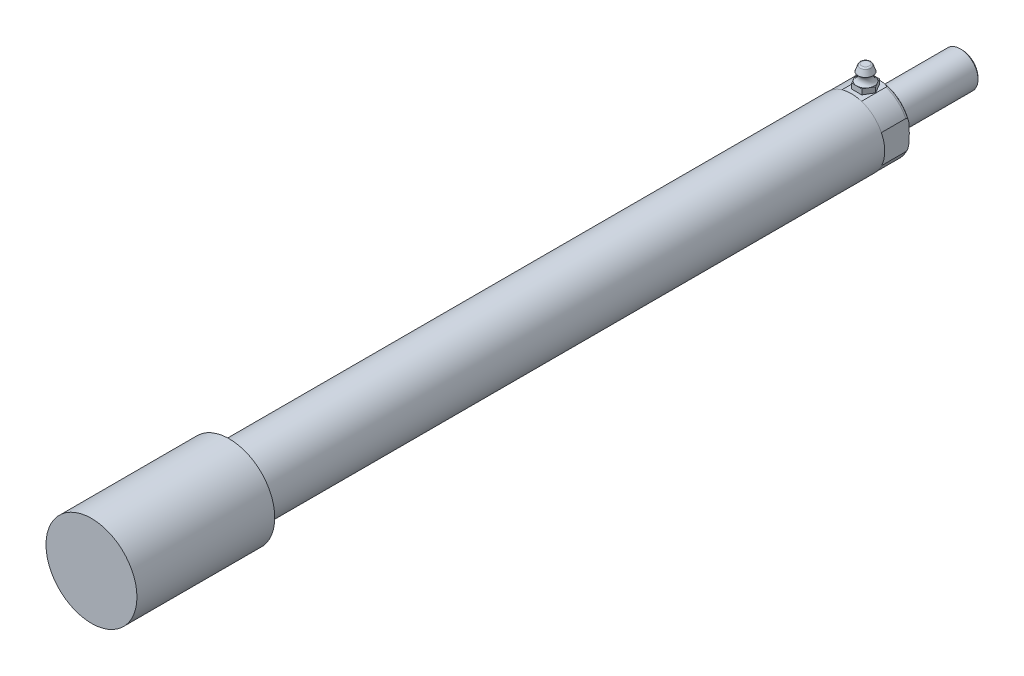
ISO-10303-21;
HEADER;
FILE_DESCRIPTION(('STEP AP214'),'2;1');
FILE_NAME('part.step','',(''),(''),'','','');
FILE_SCHEMA(('AUTOMOTIVE_DESIGN { 1 0 10303 214 1 1 1 1 }'));
ENDSEC;
DATA;
#1=APPLICATION_CONTEXT('core data for automotive mechanical design processes');
#2=APPLICATION_PROTOCOL_DEFINITION('international standard','automotive_design',2000,#1);
#3=PRODUCT_CONTEXT('',#1,'mechanical');
#4=PRODUCT('Part','Part','',(#3));
#5=PRODUCT_RELATED_PRODUCT_CATEGORY('part','',(#4));
#6=PRODUCT_DEFINITION_FORMATION('','',#4);
#7=PRODUCT_DEFINITION_CONTEXT('part definition',#1,'design');
#8=PRODUCT_DEFINITION('design','',#6,#7);
#9=PRODUCT_DEFINITION_SHAPE('','',#8);
#10=(LENGTH_UNIT() NAMED_UNIT(*) SI_UNIT(.MILLI.,.METRE.));
#11=(NAMED_UNIT(*) PLANE_ANGLE_UNIT() SI_UNIT($,.RADIAN.));
#12=(NAMED_UNIT(*) SI_UNIT($,.STERADIAN.) SOLID_ANGLE_UNIT());
#13=UNCERTAINTY_MEASURE_WITH_UNIT(LENGTH_MEASURE(1.E-05),#10,'distance_accuracy_value','');
#14=(GEOMETRIC_REPRESENTATION_CONTEXT(3) GLOBAL_UNCERTAINTY_ASSIGNED_CONTEXT((#13)) GLOBAL_UNIT_ASSIGNED_CONTEXT((#10,
#11,#12)) REPRESENTATION_CONTEXT('',''));
#15=CARTESIAN_POINT('',(0.,0.,0.));
#16=DIRECTION('',(0.,0.,1.));
#17=DIRECTION('',(1.,0.,0.));
#18=AXIS2_PLACEMENT_3D('',#15,#16,#17);
#19=CARTESIAN_POINT('',(0.,14.528460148,-301.130199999));
#20=DIRECTION('',(0.,-1.,0.));
#21=DIRECTION('',(0.,0.,-1.));
#22=AXIS2_PLACEMENT_3D('',#19,#20,#21);
#23=CYLINDRICAL_SURFACE('',#22,3.2385);
#24=CARTESIAN_POINT('',(0.,14.528460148,-301.130199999));
#25=DIRECTION('',(0.,-1.,0.));
#26=DIRECTION('',(0.,0.,-1.));
#27=AXIS2_PLACEMENT_3D('',#24,#25,#26);
#28=CIRCLE('',#27,3.2385);
#29=CARTESIAN_POINT('',(0.,14.528460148,-304.368699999));
#30=VERTEX_POINT('',#29);
#31=EDGE_CURVE('E262',#30,#30,#28,.T.);
#32=ORIENTED_EDGE('',*,*,#31,.T.);
#33=EDGE_LOOP('',(#32));
#34=FACE_BOUND('',#33,.T.);
#35=CARTESIAN_POINT('',(0.,14.289684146,-301.130199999));
#36=DIRECTION('',(0.,-1.,0.));
#37=DIRECTION('',(1.,0.,0.));
#38=AXIS2_PLACEMENT_3D('',#35,#36,#37);
#39=CIRCLE('',#38,3.2385);
#40=CARTESIAN_POINT('',(3.23850000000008,14.289684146,-301.130199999));
#41=VERTEX_POINT('',#40);
#42=EDGE_CURVE('E10',#41,#41,#39,.T.);
#43=ORIENTED_EDGE('',*,*,#42,.F.);
#44=EDGE_LOOP('',(#43));
#45=FACE_BOUND('',#44,.T.);
#46=ADVANCED_FACE('F16',(#34,#45),#23,.T.);
#47=CARTESIAN_POINT('',(-2.29135888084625,16.909710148,-305.098949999));
#48=DIRECTION('',(0.,1.,0.));
#49=DIRECTION('',(1.,0.,0.));
#50=AXIS2_PLACEMENT_3D('',#47,#48,#49);
#51=PLANE('',#50);
#52=CARTESIAN_POINT('',(0.,16.909710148,-301.130199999));
#53=DIRECTION('',(0.,-1.,0.));
#54=DIRECTION('',(0.,0.,-1.));
#55=AXIS2_PLACEMENT_3D('',#52,#53,#54);
#56=CIRCLE('',#55,3.96875);
#57=CARTESIAN_POINT('',(0.,16.909710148,-297.161449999));
#58=VERTEX_POINT('',#57);
#59=CARTESIAN_POINT('',(-3.43703832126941,16.909710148,-299.145824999));
#60=VERTEX_POINT('',#59);
#61=EDGE_CURVE('E718',#58,#60,#56,.T.);
#62=ORIENTED_EDGE('',*,*,#61,.T.);
#63=DIRECTION('',(0.5,0.,0.866025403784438));
#64=VECTOR('',#63,1.);
#65=CARTESIAN_POINT('',(-4.58271776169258,16.909710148,-301.130199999));
#66=LINE('',#65,#64);
#67=CARTESIAN_POINT('',(-2.29135888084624,16.909710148,-297.161449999));
#68=VERTEX_POINT('',#67);
#69=EDGE_CURVE('E273',#60,#68,#66,.T.);
#70=ORIENTED_EDGE('',*,*,#69,.T.);
#71=DIRECTION('',(1.,0.,0.));
#72=VECTOR('',#71,1.);
#73=CARTESIAN_POINT('',(-2.29135888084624,16.909710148,-297.161449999));
#74=LINE('',#73,#72);
#75=EDGE_CURVE('E277',#68,#58,#74,.T.);
#76=ORIENTED_EDGE('',*,*,#75,.T.);
#77=EDGE_LOOP('',(#62,#70,#76));
#78=FACE_BOUND('',#77,.T.);
#79=ADVANCED_FACE('F402',(#78),#51,.T.);
#80=CARTESIAN_POINT('',(3.43703832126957,16.909710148,-299.145824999));
#81=VERTEX_POINT('',#80);
#82=EDGE_CURVE('E725',#81,#58,#56,.T.);
#83=ORIENTED_EDGE('',*,*,#82,.T.);
#84=CARTESIAN_POINT('',(2.2913588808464,16.909710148,-297.161449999));
#85=VERTEX_POINT('',#84);
#86=EDGE_CURVE('E276',#58,#85,#74,.T.);
#87=ORIENTED_EDGE('',*,*,#86,.T.);
#88=DIRECTION('',(0.5,0.,-0.866025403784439));
#89=VECTOR('',#88,1.);
#90=CARTESIAN_POINT('',(2.2913588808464,16.909710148,-297.161449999));
#91=LINE('',#90,#89);
#92=EDGE_CURVE('E281',#85,#81,#91,.T.);
#93=ORIENTED_EDGE('',*,*,#92,.T.);
#94=EDGE_LOOP('',(#83,#87,#93));
#95=FACE_BOUND('',#94,.T.);
#96=ADVANCED_FACE('F686',(#95),#51,.T.);
#97=CARTESIAN_POINT('',(3.43703832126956,16.909710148,-303.114574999));
#98=VERTEX_POINT('',#97);
#99=EDGE_CURVE('E94',#98,#81,#56,.T.);
#100=ORIENTED_EDGE('',*,*,#99,.T.);
#101=CARTESIAN_POINT('',(4.58271776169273,16.909710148,-301.130199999));
#102=VERTEX_POINT('',#101);
#103=EDGE_CURVE('E280',#81,#102,#91,.T.);
#104=ORIENTED_EDGE('',*,*,#103,.T.);
#105=DIRECTION('',(-0.5,0.,-0.866025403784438));
#106=VECTOR('',#105,1.);
#107=CARTESIAN_POINT('',(4.58271776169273,16.909710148,-301.130199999));
#108=LINE('',#107,#106);
#109=EDGE_CURVE('E285',#102,#98,#108,.T.);
#110=ORIENTED_EDGE('',*,*,#109,.T.);
#111=EDGE_LOOP('',(#100,#104,#110));
#112=FACE_BOUND('',#111,.T.);
#113=ADVANCED_FACE('F679',(#112),#51,.T.);
#114=CARTESIAN_POINT('',(0.,16.909710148,-305.098949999));
#115=VERTEX_POINT('',#114);
#116=EDGE_CURVE('E101',#115,#98,#56,.T.);
#117=ORIENTED_EDGE('',*,*,#116,.T.);
#118=CARTESIAN_POINT('',(2.2913588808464,16.909710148,-305.098949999));
#119=VERTEX_POINT('',#118);
#120=EDGE_CURVE('E284',#98,#119,#108,.T.);
#121=ORIENTED_EDGE('',*,*,#120,.T.);
#122=DIRECTION('',(-1.,0.,0.));
#123=VECTOR('',#122,1.);
#124=CARTESIAN_POINT('',(2.2913588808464,16.909710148,-305.098949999));
#125=LINE('',#124,#123);
#126=EDGE_CURVE('E266',#119,#115,#125,.T.);
#127=ORIENTED_EDGE('',*,*,#126,.T.);
#128=EDGE_LOOP('',(#117,#121,#127));
#129=FACE_BOUND('',#128,.T.);
#130=ADVANCED_FACE('F672',(#129),#51,.T.);
#131=CARTESIAN_POINT('',(-3.43703832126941,16.909710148,-303.114574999));
#132=VERTEX_POINT('',#131);
#133=EDGE_CURVE('E259',#132,#115,#56,.T.);
#134=ORIENTED_EDGE('',*,*,#133,.T.);
#135=CARTESIAN_POINT('',(-2.29135888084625,16.909710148,-305.098949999));
#136=VERTEX_POINT('',#135);
#137=EDGE_CURVE('E269',#115,#136,#125,.T.);
#138=ORIENTED_EDGE('',*,*,#137,.T.);
#139=DIRECTION('',(-0.5,0.,0.866025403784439));
#140=VECTOR('',#139,1.);
#141=CARTESIAN_POINT('',(-2.29135888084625,16.909710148,-305.098949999));
#142=LINE('',#141,#140);
#143=EDGE_CURVE('E270',#136,#132,#142,.T.);
#144=ORIENTED_EDGE('',*,*,#143,.T.);
#145=EDGE_LOOP('',(#134,#138,#144));
#146=FACE_BOUND('',#145,.T.);
#147=ADVANCED_FACE('F372',(#146),#51,.T.);
#148=CARTESIAN_POINT('',(2.2913588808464,16.909710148,-305.098949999));
#149=DIRECTION('',(0.,0.,1.));
#150=DIRECTION('',(0.,-1.,0.));
#151=AXIS2_PLACEMENT_3D('',#148,#149,#150);
#152=PLANE('',#151);
#153=DIRECTION('',(-1.,0.,0.));
#154=VECTOR('',#153,1.);
#155=CARTESIAN_POINT('',(2.2913588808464,14.528460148,-305.098949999));
#156=LINE('',#155,#154);
#157=CARTESIAN_POINT('',(2.2913588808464,14.528460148,-305.098949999));
#158=VERTEX_POINT('',#157);
#159=CARTESIAN_POINT('',(-2.29135888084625,14.528460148,-305.098949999));
#160=VERTEX_POINT('',#159);
#161=EDGE_CURVE('E265',#158,#160,#156,.T.);
#162=ORIENTED_EDGE('',*,*,#161,.T.);
#163=DIRECTION('',(0.,-1.,0.));
#164=VECTOR('',#163,1.);
#165=CARTESIAN_POINT('',(-2.29135888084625,16.909710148,-305.098949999));
#166=LINE('',#165,#164);
#167=EDGE_CURVE('E314',#136,#160,#166,.T.);
#168=ORIENTED_EDGE('',*,*,#167,.F.);
#169=ORIENTED_EDGE('',*,*,#137,.F.);
#170=ORIENTED_EDGE('',*,*,#126,.F.);
#171=DIRECTION('',(0.,-1.,0.));
#172=VECTOR('',#171,1.);
#173=CARTESIAN_POINT('',(2.2913588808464,16.909710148,-305.098949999));
#174=LINE('',#173,#172);
#175=EDGE_CURVE('E287',#119,#158,#174,.T.);
#176=ORIENTED_EDGE('',*,*,#175,.T.);
#177=EDGE_LOOP('',(#162,#168,#169,#170,#176));
#178=FACE_BOUND('',#177,.T.);
#179=ADVANCED_FACE('F368',(#178),#152,.F.);
#180=CARTESIAN_POINT('',(-2.29135888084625,16.909710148,-305.098949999));
#181=DIRECTION('',(0.866025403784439,0.,0.5));
#182=DIRECTION('',(0.5,0.,-0.866025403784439));
#183=AXIS2_PLACEMENT_3D('',#180,#181,#182);
#184=PLANE('',#183);
#185=DIRECTION('',(-0.5,0.,0.866025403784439));
#186=VECTOR('',#185,1.);
#187=CARTESIAN_POINT('',(-2.29135888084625,14.528460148,-305.098949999));
#188=LINE('',#187,#186);
#189=CARTESIAN_POINT('',(-4.58271776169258,14.528460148,-301.130199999));
#190=VERTEX_POINT('',#189);
#191=EDGE_CURVE('E290',#160,#190,#188,.T.);
#192=ORIENTED_EDGE('',*,*,#191,.T.);
#193=DIRECTION('',(0.,-1.,0.));
#194=VECTOR('',#193,1.);
#195=CARTESIAN_POINT('',(-4.58271776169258,16.909710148,-301.130199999));
#196=LINE('',#195,#194);
#197=CARTESIAN_POINT('',(-4.58271776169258,16.909710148,-301.130199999));
#198=VERTEX_POINT('',#197);
#199=EDGE_CURVE('E311',#198,#190,#196,.T.);
#200=ORIENTED_EDGE('',*,*,#199,.F.);
#201=EDGE_CURVE('E268',#132,#198,#142,.T.);
#202=ORIENTED_EDGE('',*,*,#201,.F.);
#203=ORIENTED_EDGE('',*,*,#143,.F.);
#204=ORIENTED_EDGE('',*,*,#167,.T.);
#205=EDGE_LOOP('',(#192,#200,#202,#203,#204));
#206=FACE_BOUND('',#205,.T.);
#207=ADVANCED_FACE('F371',(#206),#184,.F.);
#208=CARTESIAN_POINT('',(-4.58271776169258,16.909710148,-301.130199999));
#209=DIRECTION('',(0.866025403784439,0.,-0.5));
#210=DIRECTION('',(-0.5,0.,-0.866025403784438));
#211=AXIS2_PLACEMENT_3D('',#208,#209,#210);
#212=PLANE('',#211);
#213=DIRECTION('',(0.5,0.,0.866025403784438));
#214=VECTOR('',#213,1.);
#215=CARTESIAN_POINT('',(-4.58271776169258,14.528460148,-301.130199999));
#216=LINE('',#215,#214);
#217=CARTESIAN_POINT('',(-2.29135888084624,14.528460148,-297.161449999));
#218=VERTEX_POINT('',#217);
#219=EDGE_CURVE('E292',#190,#218,#216,.T.);
#220=ORIENTED_EDGE('',*,*,#219,.T.);
#221=DIRECTION('',(0.,-1.,0.));
#222=VECTOR('',#221,1.);
#223=CARTESIAN_POINT('',(-2.29135888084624,16.909710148,-297.161449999));
#224=LINE('',#223,#222);
#225=EDGE_CURVE('E308',#68,#218,#224,.T.);
#226=ORIENTED_EDGE('',*,*,#225,.F.);
#227=ORIENTED_EDGE('',*,*,#69,.F.);
#228=EDGE_CURVE('E274',#198,#60,#66,.T.);
#229=ORIENTED_EDGE('',*,*,#228,.F.);
#230=ORIENTED_EDGE('',*,*,#199,.T.);
#231=EDGE_LOOP('',(#220,#226,#227,#229,#230));
#232=FACE_BOUND('',#231,.T.);
#233=ADVANCED_FACE('F376',(#232),#212,.F.);
#234=CARTESIAN_POINT('',(-2.29135888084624,16.909710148,-297.161449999));
#235=DIRECTION('',(0.,0.,-1.));
#236=DIRECTION('',(-1.,0.,0.));
#237=AXIS2_PLACEMENT_3D('',#234,#235,#236);
#238=PLANE('',#237);
#239=DIRECTION('',(1.,0.,0.));
#240=VECTOR('',#239,1.);
#241=CARTESIAN_POINT('',(-2.29135888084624,14.528460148,-297.161449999));
#242=LINE('',#241,#240);
#243=CARTESIAN_POINT('',(2.2913588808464,14.528460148,-297.161449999));
#244=VERTEX_POINT('',#243);
#245=EDGE_CURVE('E294',#218,#244,#242,.T.);
#246=ORIENTED_EDGE('',*,*,#245,.T.);
#247=DIRECTION('',(0.,-1.,0.));
#248=VECTOR('',#247,1.);
#249=CARTESIAN_POINT('',(2.2913588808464,16.909710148,-297.161449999));
#250=LINE('',#249,#248);
#251=EDGE_CURVE('E305',#85,#244,#250,.T.);
#252=ORIENTED_EDGE('',*,*,#251,.F.);
#253=ORIENTED_EDGE('',*,*,#86,.F.);
#254=ORIENTED_EDGE('',*,*,#75,.F.);
#255=ORIENTED_EDGE('',*,*,#225,.T.);
#256=EDGE_LOOP('',(#246,#252,#253,#254,#255));
#257=FACE_BOUND('',#256,.T.);
#258=ADVANCED_FACE('F380',(#257),#238,.F.);
#259=CARTESIAN_POINT('',(2.2913588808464,16.909710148,-297.161449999));
#260=DIRECTION('',(-0.866025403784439,0.,-0.5));
#261=DIRECTION('',(-0.5,0.,0.866025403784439));
#262=AXIS2_PLACEMENT_3D('',#259,#260,#261);
#263=PLANE('',#262);
#264=DIRECTION('',(0.5,0.,-0.866025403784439));
#265=VECTOR('',#264,1.);
#266=CARTESIAN_POINT('',(2.2913588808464,14.528460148,-297.161449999));
#267=LINE('',#266,#265);
#268=CARTESIAN_POINT('',(4.58271776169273,14.528460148,-301.130199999));
#269=VERTEX_POINT('',#268);
#270=EDGE_CURVE('E296',#244,#269,#267,.T.);
#271=ORIENTED_EDGE('',*,*,#270,.T.);
#272=DIRECTION('',(0.,-1.,0.));
#273=VECTOR('',#272,1.);
#274=CARTESIAN_POINT('',(4.58271776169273,16.909710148,-301.130199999));
#275=LINE('',#274,#273);
#276=EDGE_CURVE('E302',#102,#269,#275,.T.);
#277=ORIENTED_EDGE('',*,*,#276,.F.);
#278=ORIENTED_EDGE('',*,*,#103,.F.);
#279=ORIENTED_EDGE('',*,*,#92,.F.);
#280=ORIENTED_EDGE('',*,*,#251,.T.);
#281=EDGE_LOOP('',(#271,#277,#278,#279,#280));
#282=FACE_BOUND('',#281,.T.);
#283=ADVANCED_FACE('F384',(#282),#263,.F.);
#284=CARTESIAN_POINT('',(4.58271776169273,16.909710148,-301.130199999));
#285=DIRECTION('',(-0.866025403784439,0.,0.5));
#286=DIRECTION('',(0.5,0.,0.866025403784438));
#287=AXIS2_PLACEMENT_3D('',#284,#285,#286);
#288=PLANE('',#287);
#289=DIRECTION('',(-0.5,0.,-0.866025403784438));
#290=VECTOR('',#289,1.);
#291=CARTESIAN_POINT('',(4.58271776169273,14.528460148,-301.130199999));
#292=LINE('',#291,#290);
#293=EDGE_CURVE('E298',#269,#158,#292,.T.);
#294=ORIENTED_EDGE('',*,*,#293,.T.);
#295=ORIENTED_EDGE('',*,*,#175,.F.);
#296=ORIENTED_EDGE('',*,*,#120,.F.);
#297=ORIENTED_EDGE('',*,*,#109,.F.);
#298=ORIENTED_EDGE('',*,*,#276,.T.);
#299=EDGE_LOOP('',(#294,#295,#296,#297,#298));
#300=FACE_BOUND('',#299,.T.);
#301=ADVANCED_FACE('F388',(#300),#288,.F.);
#302=EDGE_CURVE('E726',#60,#132,#56,.T.);
#303=ORIENTED_EDGE('',*,*,#302,.T.);
#304=ORIENTED_EDGE('',*,*,#201,.T.);
#305=ORIENTED_EDGE('',*,*,#228,.T.);
#306=EDGE_LOOP('',(#303,#304,#305));
#307=FACE_BOUND('',#306,.T.);
#308=ADVANCED_FACE('F392',(#307),#51,.T.);
#309=CARTESIAN_POINT('',(-2.29135888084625,14.528460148,-305.098949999));
#310=DIRECTION('',(0.,1.,0.));
#311=DIRECTION('',(1.,0.,0.));
#312=AXIS2_PLACEMENT_3D('',#309,#310,#311);
#313=PLANE('',#312);
#314=ORIENTED_EDGE('',*,*,#31,.F.);
#315=EDGE_LOOP('',(#314));
#316=FACE_BOUND('',#315,.T.);
#317=ORIENTED_EDGE('',*,*,#161,.F.);
#318=ORIENTED_EDGE('',*,*,#293,.F.);
#319=ORIENTED_EDGE('',*,*,#270,.F.);
#320=ORIENTED_EDGE('',*,*,#245,.F.);
#321=ORIENTED_EDGE('',*,*,#219,.F.);
#322=ORIENTED_EDGE('',*,*,#191,.F.);
#323=EDGE_LOOP('',(#317,#318,#319,#320,#321,#322));
#324=FACE_BOUND('',#323,.T.);
#325=ADVANCED_FACE('F394',(#316,#324),#313,.F.);
#326=CARTESIAN_POINT('',(0.,20.608585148,-301.130199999));
#327=DIRECTION('',(0.,-1.,0.));
#328=DIRECTION('',(0.,0.,-1.));
#329=AXIS2_PLACEMENT_3D('',#326,#327,#328);
#330=CONICAL_SURFACE('',#329,3.3655,0.340381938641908);
#331=CARTESIAN_POINT('',(0.,23.1489766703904,-301.130199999));
#332=DIRECTION('',(0.,1.,0.));
#333=DIRECTION('',(0.,0.,1.));
#334=AXIS2_PLACEMENT_3D('',#331,#332,#333);
#335=CIRCLE('',#334,2.46577800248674);
#336=CARTESIAN_POINT('',(0.,23.1489766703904,-298.664421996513));
#337=VERTEX_POINT('',#336);
#338=EDGE_CURVE('E317',#337,#337,#335,.F.);
#339=ORIENTED_EDGE('',*,*,#338,.T.);
#340=EDGE_LOOP('',(#339));
#341=FACE_BOUND('',#340,.T.);
#342=CARTESIAN_POINT('',(0.,20.608585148,-301.130199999));
#343=DIRECTION('',(0.,-1.,0.));
#344=DIRECTION('',(0.,0.,-1.));
#345=AXIS2_PLACEMENT_3D('',#342,#343,#344);
#346=CIRCLE('',#345,3.3655);
#347=CARTESIAN_POINT('',(0.,20.608585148,-304.495699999));
#348=VERTEX_POINT('',#347);
#349=EDGE_CURVE('E256',#348,#348,#346,.T.);
#350=ORIENTED_EDGE('',*,*,#349,.F.);
#351=EDGE_LOOP('',(#350));
#352=FACE_BOUND('',#351,.T.);
#353=ADVANCED_FACE('F397',(#341,#352),#330,.T.);
#354=CARTESIAN_POINT('',(0.,23.656585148,-301.130199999));
#355=DIRECTION('',(0.,1.,0.));
#356=DIRECTION('',(0.,0.,1.));
#357=AXIS2_PLACEMENT_3D('',#354,#355,#356);
#358=PLANE('',#357);
#359=CARTESIAN_POINT('',(0.,23.656585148,-301.130199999));
#360=DIRECTION('',(0.,1.,0.));
#361=DIRECTION('',(0.,0.,1.));
#362=AXIS2_PLACEMENT_3D('',#359,#360,#361);
#363=CIRCLE('',#362,1.7474960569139);
#364=CARTESIAN_POINT('',(0.,23.656585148,-299.382703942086));
#365=VERTEX_POINT('',#364);
#366=EDGE_CURVE('E253',#365,#365,#363,.T.);
#367=ORIENTED_EDGE('',*,*,#366,.T.);
#368=EDGE_LOOP('',(#367));
#369=FACE_BOUND('',#368,.T.);
#370=ADVANCED_FACE('F405',(#369),#358,.T.);
#371=CARTESIAN_POINT('',(0.,19.0102753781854,-301.130199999));
#372=DIRECTION('',(0.,-1.,0.));
#373=DIRECTION('',(0.,0.,-1.));
#374=AXIS2_PLACEMENT_3D('',#371,#372,#373);
#375=TOROIDAL_SURFACE('',#374,5.20693450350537,2.43833450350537);
#376=ORIENTED_EDGE('',*,*,#349,.T.);
#377=EDGE_LOOP('',(#376));
#378=FACE_BOUND('',#377,.T.);
#379=ORIENTED_EDGE('',*,*,#116,.F.);
#380=ORIENTED_EDGE('',*,*,#133,.F.);
#381=ORIENTED_EDGE('',*,*,#302,.F.);
#382=ORIENTED_EDGE('',*,*,#61,.F.);
#383=ORIENTED_EDGE('',*,*,#82,.F.);
#384=ORIENTED_EDGE('',*,*,#99,.F.);
#385=EDGE_LOOP('',(#379,#380,#381,#382,#383,#384));
#386=FACE_BOUND('',#385,.T.);
#387=ADVANCED_FACE('F364',(#378,#386),#375,.F.);
#388=CARTESIAN_POINT('',(0.,22.894585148,-301.130199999));
#389=DIRECTION('',(0.,1.,0.));
#390=DIRECTION('',(0.,0.,1.));
#391=AXIS2_PLACEMENT_3D('',#388,#389,#390);
#392=TOROIDAL_SURFACE('',#391,1.7474960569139,0.762);
#393=ORIENTED_EDGE('',*,*,#366,.F.);
#394=EDGE_LOOP('',(#393));
#395=FACE_BOUND('',#394,.T.);
#396=ORIENTED_EDGE('',*,*,#338,.F.);
#397=EDGE_LOOP('',(#396));
#398=FACE_BOUND('',#397,.T.);
#399=ADVANCED_FACE('F352',(#395,#398),#392,.T.);
#400=CARTESIAN_POINT('',(0.,0.,49.7625));
#401=DIRECTION('',(0.,0.,1.));
#402=DIRECTION('',(-1.,0.,0.));
#403=AXIS2_PLACEMENT_3D('',#400,#401,#402);
#404=PLANE('',#403);
#405=CARTESIAN_POINT('',(0.,0.,49.7625));
#406=DIRECTION('',(0.,0.,1.));
#407=DIRECTION('',(-1.,0.,0.));
#408=AXIS2_PLACEMENT_3D('',#405,#406,#407);
#409=CIRCLE('',#408,20.6121);
#410=CARTESIAN_POINT('',(-20.6120999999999,0.,49.7625));
#411=VERTEX_POINT('',#410);
#412=EDGE_CURVE('E260',#411,#411,#409,.F.);
#413=ORIENTED_EDGE('',*,*,#412,.F.);
#414=EDGE_LOOP('',(#413));
#415=FACE_BOUND('',#414,.T.);
#416=ADVANCED_FACE('F332',(#415),#404,.T.);
#417=CARTESIAN_POINT('',(0.,0.,-71.0282234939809));
#418=DIRECTION('',(0.,0.,1.));
#419=DIRECTION('',(1.,0.,0.));
#420=AXIS2_PLACEMENT_3D('',#417,#418,#419);
#421=CYLINDRICAL_SURFACE('',#420,20.6121);
#422=CARTESIAN_POINT('',(0.,0.,-12.714200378));
#423=DIRECTION('',(0.,0.,1.));
#424=DIRECTION('',(1.,0.,0.));
#425=AXIS2_PLACEMENT_3D('',#422,#423,#424);
#426=CIRCLE('',#425,20.6121);
#427=CARTESIAN_POINT('',(20.6121000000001,0.,-12.714200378));
#428=VERTEX_POINT('',#427);
#429=EDGE_CURVE('E249',#428,#428,#426,.F.);
#430=ORIENTED_EDGE('',*,*,#429,.F.);
#431=EDGE_LOOP('',(#430));
#432=FACE_BOUND('',#431,.T.);
#433=ORIENTED_EDGE('',*,*,#412,.T.);
#434=EDGE_LOOP('',(#433));
#435=FACE_BOUND('',#434,.T.);
#436=ADVANCED_FACE('F354',(#432,#435),#421,.T.);
#437=CARTESIAN_POINT('',(0.,0.,-12.714200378));
#438=DIRECTION('',(0.,0.,1.));
#439=DIRECTION('',(1.,0.,0.));
#440=AXIS2_PLACEMENT_3D('',#437,#438,#439);
#441=PLANE('',#440);
#442=CARTESIAN_POINT('',(0.,0.,-12.714200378));
#443=DIRECTION('',(0.,0.,1.));
#444=DIRECTION('',(1.,0.,0.));
#445=AXIS2_PLACEMENT_3D('',#442,#443,#444);
#446=CIRCLE('',#445,15.06728);
#447=CARTESIAN_POINT('',(15.0672800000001,0.,-12.714200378));
#448=VERTEX_POINT('',#447);
#449=EDGE_CURVE('E252',#448,#448,#446,.T.);
#450=ORIENTED_EDGE('',*,*,#449,.T.);
#451=EDGE_LOOP('',(#450));
#452=FACE_BOUND('',#451,.T.);
#453=ORIENTED_EDGE('',*,*,#429,.T.);
#454=EDGE_LOOP('',(#453));
#455=FACE_BOUND('',#454,.T.);
#456=ADVANCED_FACE('F351',(#452,#455),#441,.F.);
#457=CARTESIAN_POINT('',(0.,0.,-9.525));
#458=DIRECTION('',(0.,0.,1.));
#459=DIRECTION('',(0.,-1.,0.));
#460=AXIS2_PLACEMENT_3D('',#457,#458,#459);
#461=CYLINDRICAL_SURFACE('',#460,15.06728);
#462=CARTESIAN_POINT('',(0.,0.,-294.780199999));
#463=DIRECTION('',(0.,0.,1.));
#464=DIRECTION('',(0.,-1.,0.));
#465=AXIS2_PLACEMENT_3D('',#462,#463,#464);
#466=CIRCLE('',#465,15.06728);
#467=CARTESIAN_POINT('',(0.,-15.06728,-294.780199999));
#468=VERTEX_POINT('',#467);
#469=EDGE_CURVE('E20',#468,#468,#466,.T.);
#470=ORIENTED_EDGE('',*,*,#469,.T.);
#471=EDGE_LOOP('',(#470));
#472=FACE_BOUND('',#471,.T.);
#473=ORIENTED_EDGE('',*,*,#449,.F.);
#474=EDGE_LOOP('',(#473));
#475=FACE_BOUND('',#474,.T.);
#476=ADVANCED_FACE('F327',(#472,#475),#461,.T.);
#477=CARTESIAN_POINT('',(0.,0.,-294.780199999));
#478=DIRECTION('',(0.,0.,-1.));
#479=DIRECTION('',(0.,1.,0.));
#480=AXIS2_PLACEMENT_3D('',#477,#478,#479);
#481=PLANE('',#480);
#482=ORIENTED_EDGE('',*,*,#469,.F.);
#483=EDGE_LOOP('',(#482));
#484=FACE_BOUND('',#483,.T.);
#485=CARTESIAN_POINT('',(0.,0.,-294.780199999));
#486=DIRECTION('',(0.,0.,-1.));
#487=DIRECTION('',(0.,-1.,0.));
#488=AXIS2_PLACEMENT_3D('',#485,#486,#487);
#489=CIRCLE('',#488,14.9733);
#490=CARTESIAN_POINT('',(-13.4874,6.50305729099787,-294.780199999));
#491=VERTEX_POINT('',#490);
#492=CARTESIAN_POINT('',(-4.47265468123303,14.289684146,-294.780199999));
#493=VERTEX_POINT('',#492);
#494=EDGE_CURVE('E213',#491,#493,#489,.T.);
#495=ORIENTED_EDGE('',*,*,#494,.F.);
#496=DIRECTION('',(0.,-1.,0.));
#497=VECTOR('',#496,1.);
#498=CARTESIAN_POINT('',(-13.4874,6.50305729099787,-294.780199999));
#499=LINE('',#498,#497);
#500=CARTESIAN_POINT('',(-13.4874,-6.50305729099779,-294.780199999));
#501=VERTEX_POINT('',#500);
#502=EDGE_CURVE('E336',#491,#501,#499,.T.);
#503=ORIENTED_EDGE('',*,*,#502,.T.);
#504=CARTESIAN_POINT('',(13.4874,-6.5030572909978,-294.780199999));
#505=VERTEX_POINT('',#504);
#506=EDGE_CURVE('E215',#505,#501,#489,.T.);
#507=ORIENTED_EDGE('',*,*,#506,.F.);
#508=DIRECTION('',(0.,1.,0.));
#509=VECTOR('',#508,1.);
#510=CARTESIAN_POINT('',(13.4874,6.50305729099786,-294.780199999));
#511=LINE('',#510,#509);
#512=CARTESIAN_POINT('',(13.4874,6.50305729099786,-294.780199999));
#513=VERTEX_POINT('',#512);
#514=EDGE_CURVE('E154',#505,#513,#511,.T.);
#515=ORIENTED_EDGE('',*,*,#514,.T.);
#516=CARTESIAN_POINT('',(4.47265468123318,14.289684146,-294.780199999));
#517=VERTEX_POINT('',#516);
#518=EDGE_CURVE('E211',#517,#513,#489,.T.);
#519=ORIENTED_EDGE('',*,*,#518,.F.);
#520=DIRECTION('',(-1.,0.,0.));
#521=VECTOR('',#520,1.);
#522=CARTESIAN_POINT('',(4.47265468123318,14.289684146,-294.780199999));
#523=LINE('',#522,#521);
#524=EDGE_CURVE('E107',#517,#493,#523,.T.);
#525=ORIENTED_EDGE('',*,*,#524,.T.);
#526=EDGE_LOOP('',(#495,#503,#507,#515,#519,#525));
#527=FACE_BOUND('',#526,.T.);
#528=ADVANCED_FACE('F18',(#484,#527),#481,.T.);
#529=CARTESIAN_POINT('',(0.,8.,-344.818199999));
#530=DIRECTION('',(0.,0.,1.));
#531=DIRECTION('',(0.,1.,0.));
#532=AXIS2_PLACEMENT_3D('',#529,#530,#531);
#533=PLANE('',#532);
#534=CARTESIAN_POINT('',(0.,0.,-344.818199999));
#535=DIRECTION('',(0.,0.,1.));
#536=DIRECTION('',(0.,1.,0.));
#537=AXIS2_PLACEMENT_3D('',#534,#535,#536);
#538=CIRCLE('',#537,7.3142);
#539=CARTESIAN_POINT('',(0.,7.31420000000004,-344.818199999));
#540=VERTEX_POINT('',#539);
#541=EDGE_CURVE('E238',#540,#540,#538,.F.);
#542=ORIENTED_EDGE('',*,*,#541,.T.);
#543=EDGE_LOOP('',(#542));
#544=FACE_BOUND('',#543,.T.);
#545=ADVANCED_FACE('F186',(#544),#533,.F.);
#546=CARTESIAN_POINT('',(0.,0.,-344.818199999));
#547=DIRECTION('',(0.,0.,1.));
#548=DIRECTION('',(0.,1.,0.));
#549=AXIS2_PLACEMENT_3D('',#546,#547,#548);
#550=CONICAL_SURFACE('',#549,7.3142,0.785398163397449);
#551=CARTESIAN_POINT('',(0.,0.,-344.132399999));
#552=DIRECTION('',(0.,0.,1.));
#553=DIRECTION('',(0.,1.,0.));
#554=AXIS2_PLACEMENT_3D('',#551,#552,#553);
#555=CIRCLE('',#554,8.);
#556=CARTESIAN_POINT('',(0.,8.00000000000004,-344.132399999));
#557=VERTEX_POINT('',#556);
#558=EDGE_CURVE('E241',#557,#557,#555,.T.);
#559=ORIENTED_EDGE('',*,*,#558,.F.);
#560=EDGE_LOOP('',(#559));
#561=FACE_BOUND('',#560,.T.);
#562=ORIENTED_EDGE('',*,*,#541,.F.);
#563=EDGE_LOOP('',(#562));
#564=FACE_BOUND('',#563,.T.);
#565=ADVANCED_FACE('F189',(#561,#564),#550,.T.);
#566=CARTESIAN_POINT('',(0.,0.,-312.204412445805));
#567=DIRECTION('',(0.,0.,-1.));
#568=DIRECTION('',(0.,-1.,0.));
#569=AXIS2_PLACEMENT_3D('',#566,#567,#568);
#570=CYLINDRICAL_SURFACE('',#569,8.);
#571=CARTESIAN_POINT('',(0.,0.,-308.750199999));
#572=DIRECTION('',(0.,0.,1.));
#573=DIRECTION('',(0.,1.,0.));
#574=AXIS2_PLACEMENT_3D('',#571,#572,#573);
#575=CIRCLE('',#574,8.);
#576=CARTESIAN_POINT('',(0.,8.00000000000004,-308.750199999));
#577=VERTEX_POINT('',#576);
#578=EDGE_CURVE('E244',#577,#577,#575,.F.);
#579=ORIENTED_EDGE('',*,*,#578,.T.);
#580=EDGE_LOOP('',(#579));
#581=FACE_BOUND('',#580,.T.);
#582=ORIENTED_EDGE('',*,*,#558,.T.);
#583=EDGE_LOOP('',(#582));
#584=FACE_BOUND('',#583,.T.);
#585=ADVANCED_FACE('F191',(#581,#584),#570,.T.);
#586=CARTESIAN_POINT('',(0.,0.,-308.750199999));
#587=DIRECTION('',(0.,0.,1.));
#588=DIRECTION('',(0.,1.,0.));
#589=AXIS2_PLACEMENT_3D('',#586,#587,#588);
#590=TOROIDAL_SURFACE('',#589,9.27,1.27);
#591=CARTESIAN_POINT('',(0.,0.,-307.480199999));
#592=DIRECTION('',(0.,0.,1.));
#593=DIRECTION('',(0.,1.,0.));
#594=AXIS2_PLACEMENT_3D('',#591,#592,#593);
#595=CIRCLE('',#594,9.27);
#596=CARTESIAN_POINT('',(0.,9.27000000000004,-307.480199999));
#597=VERTEX_POINT('',#596);
#598=EDGE_CURVE('E26',#597,#597,#595,.T.);
#599=ORIENTED_EDGE('',*,*,#598,.F.);
#600=EDGE_LOOP('',(#599));
#601=FACE_BOUND('',#600,.T.);
#602=ORIENTED_EDGE('',*,*,#578,.F.);
#603=EDGE_LOOP('',(#602));
#604=FACE_BOUND('',#603,.T.);
#605=ADVANCED_FACE('F194',(#601,#604),#590,.F.);
#606=CARTESIAN_POINT('',(0.,8.,-307.480199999));
#607=DIRECTION('',(0.,0.,1.));
#608=DIRECTION('',(0.,1.,0.));
#609=AXIS2_PLACEMENT_3D('',#606,#607,#608);
#610=PLANE('',#609);
#611=ORIENTED_EDGE('',*,*,#598,.T.);
#612=EDGE_LOOP('',(#611));
#613=FACE_BOUND('',#612,.T.);
#614=CARTESIAN_POINT('',(0.,0.,-307.480199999));
#615=DIRECTION('',(0.,0.,1.));
#616=DIRECTION('',(0.,1.,0.));
#617=AXIS2_PLACEMENT_3D('',#614,#615,#616);
#618=CIRCLE('',#617,13.3858);
#619=CARTESIAN_POINT('',(0.,13.3858,-307.480199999));
#620=VERTEX_POINT('',#619);
#621=EDGE_CURVE('E146',#620,#620,#618,.F.);
#622=ORIENTED_EDGE('',*,*,#621,.T.);
#623=EDGE_LOOP('',(#622));
#624=FACE_BOUND('',#623,.T.);
#625=ADVANCED_FACE('F196',(#613,#624),#610,.F.);
#626=CARTESIAN_POINT('',(0.,0.,-312.204412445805));
#627=DIRECTION('',(0.,0.,-1.));
#628=DIRECTION('',(0.,-1.,0.));
#629=AXIS2_PLACEMENT_3D('',#626,#627,#628);
#630=CYLINDRICAL_SURFACE('',#629,14.9733);
#631=ORIENTED_EDGE('',*,*,#506,.T.);
#632=DIRECTION('',(0.,0.,-1.));
#633=VECTOR('',#632,1.);
#634=CARTESIAN_POINT('',(-13.4874,-6.50305729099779,-294.780199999));
#635=LINE('',#634,#633);
#636=CARTESIAN_POINT('',(-13.4874,-6.50305729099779,-305.892699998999));
#637=VERTEX_POINT('',#636);
#638=EDGE_CURVE('E141',#501,#637,#635,.T.);
#639=ORIENTED_EDGE('',*,*,#638,.T.);
#640=CARTESIAN_POINT('',(0.,0.,-305.892699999));
#641=DIRECTION('',(0.,0.,1.));
#642=DIRECTION('',(0.,1.,0.));
#643=AXIS2_PLACEMENT_3D('',#640,#641,#642);
#644=CIRCLE('',#643,14.9733);
#645=CARTESIAN_POINT('',(13.4874,-6.50305729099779,-305.892699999));
#646=VERTEX_POINT('',#645);
#647=EDGE_CURVE('E136',#637,#646,#644,.T.);
#648=ORIENTED_EDGE('',*,*,#647,.T.);
#649=DIRECTION('',(0.,0.,-1.));
#650=VECTOR('',#649,1.);
#651=CARTESIAN_POINT('',(13.4874,-6.5030572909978,-294.780199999));
#652=LINE('',#651,#650);
#653=EDGE_CURVE('E139',#505,#646,#652,.T.);
#654=ORIENTED_EDGE('',*,*,#653,.F.);
#655=EDGE_LOOP('',(#631,#639,#648,#654));
#656=FACE_BOUND('',#655,.T.);
#657=ADVANCED_FACE('F138',(#656),#630,.T.);
#658=CARTESIAN_POINT('',(13.4874,6.50305729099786,-305.892699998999));
#659=VERTEX_POINT('',#658);
#660=CARTESIAN_POINT('',(4.47265468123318,14.289684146,-305.892699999));
#661=VERTEX_POINT('',#660);
#662=EDGE_CURVE('E148',#659,#661,#644,.T.);
#663=ORIENTED_EDGE('',*,*,#662,.T.);
#664=DIRECTION('',(0.,0.,-1.));
#665=VECTOR('',#664,1.);
#666=CARTESIAN_POINT('',(4.47265468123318,14.289684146,-294.780199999));
#667=LINE('',#666,#665);
#668=EDGE_CURVE('E35',#517,#661,#667,.T.);
#669=ORIENTED_EDGE('',*,*,#668,.F.);
#670=ORIENTED_EDGE('',*,*,#518,.T.);
#671=DIRECTION('',(0.,0.,-1.));
#672=VECTOR('',#671,1.);
#673=CARTESIAN_POINT('',(13.4874,6.50305729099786,-294.780199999));
#674=LINE('',#673,#672);
#675=EDGE_CURVE('E156',#513,#659,#674,.T.);
#676=ORIENTED_EDGE('',*,*,#675,.T.);
#677=EDGE_LOOP('',(#663,#669,#670,#676));
#678=FACE_BOUND('',#677,.T.);
#679=ADVANCED_FACE('F199',(#678),#630,.T.);
#680=ORIENTED_EDGE('',*,*,#494,.T.);
#681=DIRECTION('',(0.,0.,-1.));
#682=VECTOR('',#681,1.);
#683=CARTESIAN_POINT('',(-4.47265468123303,14.289684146,-294.780199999));
#684=LINE('',#683,#682);
#685=CARTESIAN_POINT('',(-4.47265468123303,14.289684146,-305.892699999));
#686=VERTEX_POINT('',#685);
#687=EDGE_CURVE('E342',#493,#686,#684,.T.);
#688=ORIENTED_EDGE('',*,*,#687,.T.);
#689=CARTESIAN_POINT('',(-13.4874,6.50305729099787,-305.892699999));
#690=VERTEX_POINT('',#689);
#691=EDGE_CURVE('E145',#686,#690,#644,.T.);
#692=ORIENTED_EDGE('',*,*,#691,.T.);
#693=DIRECTION('',(0.,0.,-1.));
#694=VECTOR('',#693,1.);
#695=CARTESIAN_POINT('',(-13.4874,6.50305729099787,-294.780199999));
#696=LINE('',#695,#694);
#697=EDGE_CURVE('E339',#491,#690,#696,.T.);
#698=ORIENTED_EDGE('',*,*,#697,.F.);
#699=EDGE_LOOP('',(#680,#688,#692,#698));
#700=FACE_BOUND('',#699,.T.);
#701=ADVANCED_FACE('F201',(#700),#630,.T.);
#702=CARTESIAN_POINT('',(0.,0.,-305.892699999));
#703=DIRECTION('',(0.,0.,1.));
#704=DIRECTION('',(0.,1.,0.));
#705=AXIS2_PLACEMENT_3D('',#702,#703,#704);
#706=TOROIDAL_SURFACE('',#705,13.3858,1.5875);
#707=CARTESIAN_POINT('',(0.,14.289684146,-307.197747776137));
#708=CARTESIAN_POINT('',(-0.133646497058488,14.289684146,-307.197741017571));
#709=CARTESIAN_POINT('',(-0.267287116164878,14.289684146,-307.196452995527));
#710=CARTESIAN_POINT('',(-0.534506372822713,14.289684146,-307.191218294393));
#711=CARTESIAN_POINT('',(-0.668085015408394,14.289684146,-307.187271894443));
#712=CARTESIAN_POINT('',(-0.935315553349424,14.289684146,-307.176516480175));
#713=CARTESIAN_POINT('',(-1.06896728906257,14.289684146,-307.169703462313));
#714=CARTESIAN_POINT('',(-1.33606925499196,14.289684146,-307.152853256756));
#715=CARTESIAN_POINT('',(-1.46951948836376,14.289684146,-307.142816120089));
#716=CARTESIAN_POINT('',(-1.73543991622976,14.289684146,-307.119033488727));
#717=CARTESIAN_POINT('',(-1.86791171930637,14.289684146,-307.105306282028));
#718=CARTESIAN_POINT('',(-2.13230963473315,14.289684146,-307.073357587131));
#719=CARTESIAN_POINT('',(-2.26423580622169,14.289684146,-307.055136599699));
#720=CARTESIAN_POINT('',(-2.52694597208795,14.289684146,-307.013149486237));
#721=CARTESIAN_POINT('',(-2.6577317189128,14.289684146,-306.989394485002));
#722=CARTESIAN_POINT('',(-2.91778720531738,14.289684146,-306.934772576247));
#723=CARTESIAN_POINT('',(-3.04705781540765,14.289684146,-306.903909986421));
#724=CARTESIAN_POINT('',(-3.23928449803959,14.289684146,-306.850375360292));
#725=CARTESIAN_POINT('',(-3.30323362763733,14.289684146,-306.831268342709));
#726=CARTESIAN_POINT('',(-3.430240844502,14.289684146,-306.790180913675));
#727=CARTESIAN_POINT('',(-3.49329857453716,14.289684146,-306.768199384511));
#728=CARTESIAN_POINT('',(-3.61789051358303,14.289684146,-306.720885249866));
#729=CARTESIAN_POINT('',(-3.67942948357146,14.289684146,-306.695565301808));
#730=CARTESIAN_POINT('',(-3.80060453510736,14.289684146,-306.640761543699));
#731=CARTESIAN_POINT('',(-3.86024203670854,14.289684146,-306.611280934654));
#732=CARTESIAN_POINT('',(-3.9649820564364,14.289684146,-306.553523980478));
#733=CARTESIAN_POINT('',(-4.01060064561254,14.289684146,-306.526192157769));
#734=CARTESIAN_POINT('',(-4.09927870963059,14.289684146,-306.467365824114));
#735=CARTESIAN_POINT('',(-4.14233196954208,14.289684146,-306.435861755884));
#736=CARTESIAN_POINT('',(-4.22485518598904,14.289684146,-306.367399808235));
#737=CARTESIAN_POINT('',(-4.26427382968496,14.289684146,-306.330378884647));
#738=CARTESIAN_POINT('',(-4.33623891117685,14.289684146,-306.250165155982));
#739=CARTESIAN_POINT('',(-4.36881659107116,14.289684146,-306.207001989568));
#740=CARTESIAN_POINT('',(-4.41075181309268,14.289684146,-306.134970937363));
#741=CARTESIAN_POINT('',(-4.42397232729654,14.289684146,-306.108366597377));
#742=CARTESIAN_POINT('',(-4.44610168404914,14.289684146,-306.05340854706));
#743=CARTESIAN_POINT('',(-4.45501495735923,14.289684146,-306.02505666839));
#744=CARTESIAN_POINT('',(-4.46773913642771,14.289684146,-305.966955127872));
#745=CARTESIAN_POINT('',(-4.47150742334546,14.289684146,-305.937195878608));
#746=CARTESIAN_POINT('',(-4.47334943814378,14.289684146,-305.877500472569));
#747=CARTESIAN_POINT('',(-4.47142442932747,14.289684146,-305.847564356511));
#748=CARTESIAN_POINT('',(-4.46257251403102,14.289684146,-305.791407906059));
#749=CARTESIAN_POINT('',(-4.4561419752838,14.289684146,-305.765106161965));
#750=CARTESIAN_POINT('',(-4.43939511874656,14.289684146,-305.71378315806));
#751=CARTESIAN_POINT('',(-4.42907665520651,14.289684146,-305.688762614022));
#752=CARTESIAN_POINT('',(-4.39901641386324,14.289684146,-305.627633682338));
#753=CARTESIAN_POINT('',(-4.37716827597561,14.289684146,-305.592566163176));
#754=CARTESIAN_POINT('',(-4.32830516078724,14.289684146,-305.526241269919));
#755=CARTESIAN_POINT('',(-4.30127538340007,14.289684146,-305.494995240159));
#756=CARTESIAN_POINT('',(-4.22159172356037,14.289684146,-305.413275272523));
#757=CARTESIAN_POINT('',(-4.16520932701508,14.289684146,-305.366478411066));
#758=CARTESIAN_POINT('',(-4.04661087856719,14.289684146,-305.281163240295));
#759=CARTESIAN_POINT('',(-3.98438060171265,14.289684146,-305.242665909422));
#760=CARTESIAN_POINT('',(-3.82924275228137,14.289684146,-305.156895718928));
#761=CARTESIAN_POINT('',(-3.73456056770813,14.289684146,-305.11287148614));
#762=CARTESIAN_POINT('',(-3.5414455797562,14.289684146,-305.033824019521));
#763=CARTESIAN_POINT('',(-3.4430051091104,14.289684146,-304.998820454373));
#764=CARTESIAN_POINT('',(-3.24336754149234,14.289684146,-304.935435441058));
#765=CARTESIAN_POINT('',(-3.14215704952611,14.289684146,-304.90709680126));
#766=CARTESIAN_POINT('',(-2.93852321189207,14.289684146,-304.855819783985));
#767=CARTESIAN_POINT('',(-2.83610130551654,14.289684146,-304.83287556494));
#768=CARTESIAN_POINT('',(-2.63899049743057,14.289684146,-304.793025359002));
#769=CARTESIAN_POINT('',(-2.54437015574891,14.289684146,-304.775775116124));
#770=CARTESIAN_POINT('',(-2.3546242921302,14.289684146,-304.744295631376));
#771=CARTESIAN_POINT('',(-2.2594987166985,14.289684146,-304.730066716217));
#772=CARTESIAN_POINT('',(-1.97351201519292,14.289684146,-304.691191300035));
#773=CARTESIAN_POINT('',(-1.78212974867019,14.289684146,-304.670373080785));
#774=CARTESIAN_POINT('',(-1.3982011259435,14.289684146,-304.636386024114));
#775=CARTESIAN_POINT('',(-1.20565301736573,14.289684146,-304.623238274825));
#776=CARTESIAN_POINT('',(-0.820290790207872,14.289684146,-304.603225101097));
#777=CARTESIAN_POINT('',(-0.627476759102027,14.289684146,-304.596357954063));
#778=CARTESIAN_POINT('',(-0.241925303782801,14.289684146,-304.588153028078));
#779=CARTESIAN_POINT('',(-0.0491879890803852,14.289684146,-304.586809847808));
#780=CARTESIAN_POINT('',(0.336278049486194,14.289684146,-304.589493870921));
#781=CARTESIAN_POINT('',(0.529006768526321,14.289684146,-304.593521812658));
#782=CARTESIAN_POINT('',(0.913879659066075,14.289684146,-304.607372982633));
#783=CARTESIAN_POINT('',(1.10602423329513,14.289684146,-304.617184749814));
#784=CARTESIAN_POINT('',(1.489822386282,14.289684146,-304.643656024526));
#785=CARTESIAN_POINT('',(1.68147606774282,14.289684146,-304.660313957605));
#786=CARTESIAN_POINT('',(2.00330883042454,14.289684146,-304.695744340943));
#787=CARTESIAN_POINT('',(2.13374342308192,14.289684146,-304.712178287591));
#788=CARTESIAN_POINT('',(2.39396735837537,14.289684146,-304.750105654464));
#789=CARTESIAN_POINT('',(2.52375630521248,14.289684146,-304.771601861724));
#790=CARTESIAN_POINT('',(2.78208566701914,14.289684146,-304.82097679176));
#791=CARTESIAN_POINT('',(2.91062649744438,14.289684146,-304.848853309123));
#792=CARTESIAN_POINT('',(3.1655784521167,14.289684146,-304.912937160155));
#793=CARTESIAN_POINT('',(3.29199152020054,14.289684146,-304.949136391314));
#794=CARTESIAN_POINT('',(3.47931053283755,14.289684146,-305.012279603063));
#795=CARTESIAN_POINT('',(3.54166003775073,14.289684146,-305.034931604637));
#796=CARTESIAN_POINT('',(3.66493512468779,14.289684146,-305.083799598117));
#797=CARTESIAN_POINT('',(3.72586133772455,14.289684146,-305.11001397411));
#798=CARTESIAN_POINT('',(3.84547790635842,14.289684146,-305.166742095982));
#799=CARTESIAN_POINT('',(3.90417448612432,14.289684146,-305.197242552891));
#800=CARTESIAN_POINT('',(4.01835358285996,14.289684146,-305.263692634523));
#801=CARTESIAN_POINT('',(4.07384154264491,14.289684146,-305.299632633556));
#802=CARTESIAN_POINT('',(4.17071214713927,14.289684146,-305.371863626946));
#803=CARTESIAN_POINT('',(4.2128935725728,14.289684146,-305.40706821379));
#804=CARTESIAN_POINT('',(4.29150006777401,14.289684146,-305.483400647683));
#805=CARTESIAN_POINT('',(4.32794597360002,14.289684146,-305.524505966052));
#806=CARTESIAN_POINT('',(4.37815530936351,14.289684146,-305.594866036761));
#807=CARTESIAN_POINT('',(4.39502882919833,14.289684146,-305.621882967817));
#808=CARTESIAN_POINT('',(4.42455057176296,14.289684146,-305.678167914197));
#809=CARTESIAN_POINT('',(4.4372013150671,14.289684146,-305.707434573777));
#810=CARTESIAN_POINT('',(4.45724973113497,14.289684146,-305.768145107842));
#811=CARTESIAN_POINT('',(4.46458436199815,14.289684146,-305.799610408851));
#812=CARTESIAN_POINT('',(4.47281725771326,14.289684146,-305.863364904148));
#813=CARTESIAN_POINT('',(4.47372363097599,14.289684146,-305.895653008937));
#814=CARTESIAN_POINT('',(4.46933568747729,14.289684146,-305.95521462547));
#815=CARTESIAN_POINT('',(4.46489387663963,14.289684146,-305.982555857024));
#816=CARTESIAN_POINT('',(4.45163704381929,14.289684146,-306.036153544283));
#817=CARTESIAN_POINT('',(4.44281862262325,14.289684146,-306.062409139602));
#818=CARTESIAN_POINT('',(4.41752420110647,14.289684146,-306.122893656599));
#819=CARTESIAN_POINT('',(4.39941805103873,14.289684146,-306.156435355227));
#820=CARTESIAN_POINT('',(4.35815547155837,14.289684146,-306.220236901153));
#821=CARTESIAN_POINT('',(4.33498741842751,14.289684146,-306.250488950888));
#822=CARTESIAN_POINT('',(4.26789958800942,14.289684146,-306.327691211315));
#823=CARTESIAN_POINT('',(4.22069407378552,14.289684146,-306.371754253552));
#824=CARTESIAN_POINT('',(4.12057833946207,14.289684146,-306.452742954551));
#825=CARTESIAN_POINT('',(4.06765232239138,14.289684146,-306.489648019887));
#826=CARTESIAN_POINT('',(3.94000031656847,14.289684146,-306.569323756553));
#827=CARTESIAN_POINT('',(3.86392274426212,14.289684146,-306.609901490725));
#828=CARTESIAN_POINT('',(3.70824604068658,14.289684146,-306.683748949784));
#829=CARTESIAN_POINT('',(3.62864023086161,14.289684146,-306.717004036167));
#830=CARTESIAN_POINT('',(3.4669522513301,14.289684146,-306.777982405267));
#831=CARTESIAN_POINT('',(3.38486046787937,14.289684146,-306.805679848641));
#832=CARTESIAN_POINT('',(3.21938391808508,14.289684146,-306.856512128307));
#833=CARTESIAN_POINT('',(3.13600040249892,14.289684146,-306.87965111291));
#834=CARTESIAN_POINT('',(2.92835853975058,14.289684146,-306.932405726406));
#835=CARTESIAN_POINT('',(2.80355303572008,14.289684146,-306.959854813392));
#836=CARTESIAN_POINT('',(2.55273685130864,14.289684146,-307.0086389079));
#837=CARTESIAN_POINT('',(2.42672569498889,14.289684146,-307.029971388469));
#838=CARTESIAN_POINT('',(2.17376222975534,14.289684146,-307.067799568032));
#839=CARTESIAN_POINT('',(2.04680864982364,14.289684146,-307.084286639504));
#840=CARTESIAN_POINT('',(1.79247093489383,14.289684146,-307.113267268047));
#841=CARTESIAN_POINT('',(1.66508685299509,14.289684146,-307.12576130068));
#842=CARTESIAN_POINT('',(1.40976461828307,14.289684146,-307.147421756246));
#843=CARTESIAN_POINT('',(1.28182586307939,14.289684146,-307.156580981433));
#844=CARTESIAN_POINT('',(1.02577071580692,14.289684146,-307.171979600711));
#845=CARTESIAN_POINT('',(0.897654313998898,14.289684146,-307.178218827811));
#846=CARTESIAN_POINT('',(0.513124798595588,14.289684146,-307.193052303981));
#847=CARTESIAN_POINT('',(0.256551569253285,14.289684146,-307.19776075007));
#848=CARTESIAN_POINT('',(0.,14.289684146,-307.197747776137));
#849=B_SPLINE_CURVE_WITH_KNOTS('',3,(#707,#708,#709,#710,#711,#712,#713,#714,#715,#716,#717,
#718,#719,#720,#721,#722,#723,#724,#725,#726,#727,#728,#729,#730,#731,#732,#733,#734,#735,#736,
#737,#738,#739,#740,#741,#742,#743,#744,#745,#746,#747,#748,#749,#750,#751,#752,#753,#754,#755,
#756,#757,#758,#759,#760,#761,#762,#763,#764,#765,#766,#767,#768,#769,#770,#771,#772,#773,#774,
#775,#776,#777,#778,#779,#780,#781,#782,#783,#784,#785,#786,#787,#788,#789,#790,#791,#792,#793,
#794,#795,#796,#797,#798,#799,#800,#801,#802,#803,#804,#805,#806,#807,#808,#809,#810,#811,#812,
#813,#814,#815,#816,#817,#818,#819,#820,#821,#822,#823,#824,#825,#826,#827,#828,#829,#830,#831,
#832,#833,#834,#835,#836,#837,#838,#839,#840,#841,#842,#843,#844,#845,#846,#847,#848),
.UNSPECIFIED.,.T.,.F.,(4,2,2,2,2,2,2,2,2,2,2,2,2,2,2,2,2,2,2,2,2,2,2,2,2,2,2,2,2,2,2,2,2,2,2,2,
2,2,2,2,2,2,2,2,2,2,2,2,2,2,2,2,2,2,2,2,2,2,2,2,2,2,2,2,2,2,2,2,2,2,4),(0.,0.400922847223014,
0.801803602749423,1.20324610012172,1.60468224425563,2.00416442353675,2.40360210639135,
2.80224364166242,3.20064364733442,3.40081956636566,3.60107355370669,3.80058902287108,
3.99995182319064,4.15932643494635,4.31907265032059,4.48080864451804,4.64178911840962,
4.73061858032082,4.81935646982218,4.90882505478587,4.99827378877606,5.07916134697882,
5.16009361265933,5.28333180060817,5.40692737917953,5.62550642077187,5.84463164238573,
6.15711023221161,6.47026449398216,6.78537831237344,7.100149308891,7.38863172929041,
7.67714532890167,8.25444344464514,8.83332131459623,9.41204036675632,9.99019341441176,
10.5684259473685,11.1455165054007,11.722474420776,12.1167979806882,12.5113391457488,
12.9057441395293,13.2997667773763,13.4986946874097,13.6975326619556,13.8957672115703,
14.093654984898,14.2580901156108,14.4219133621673,14.5171910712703,14.6124118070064,
14.7087440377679,14.8049547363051,14.8876607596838,14.9704311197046,15.0841343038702,
15.198101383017,15.390732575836,15.5839100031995,15.8419679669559,16.1005372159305,
16.3602821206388,16.6197895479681,17.0029340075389,17.3862365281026,17.7702174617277,
18.1541526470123,18.5389116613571,18.9236926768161,19.6933154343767),.UNSPECIFIED.);
#850=EDGE_CURVE('E164',#661,#686,#849,.T.);
#851=ORIENTED_EDGE('',*,*,#850,.F.);
#852=ORIENTED_EDGE('',*,*,#662,.F.);
#853=CARTESIAN_POINT('',(13.4874,0.,-307.476945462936));
#854=CARTESIAN_POINT('',(13.4874,0.264666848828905,-307.476949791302));
#855=CARTESIAN_POINT('',(13.4874,0.529334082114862,-307.47650501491));
#856=CARTESIAN_POINT('',(13.4874,1.05869657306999,-307.474044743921));
#857=CARTESIAN_POINT('',(13.4874,1.323391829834,-307.472029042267));
#858=CARTESIAN_POINT('',(13.4874,1.85278002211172,-307.464383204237));
#859=CARTESIAN_POINT('',(13.4874,2.11747295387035,-307.458752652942));
#860=CARTESIAN_POINT('',(13.4874,2.51430953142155,-307.444981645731));
#861=CARTESIAN_POINT('',(13.4874,2.64654193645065,-307.439504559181));
#862=CARTESIAN_POINT('',(13.4874,2.91088509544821,-307.426178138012));
#863=CARTESIAN_POINT('',(13.4874,3.04299585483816,-307.418328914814));
#864=CARTESIAN_POINT('',(13.4874,3.29709701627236,-307.40026955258));
#865=CARTESIAN_POINT('',(13.4874,3.41910282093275,-307.390280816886));
#866=CARTESIAN_POINT('',(13.4874,3.66281905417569,-307.367013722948));
#867=CARTESIAN_POINT('',(13.4874,3.78452945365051,-307.353735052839));
#868=CARTESIAN_POINT('',(13.4874,4.02759014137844,-307.323064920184));
#869=CARTESIAN_POINT('',(13.4874,4.14893981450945,-307.305668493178));
#870=CARTESIAN_POINT('',(13.4874,4.3907928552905,-307.265775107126));
#871=CARTESIAN_POINT('',(13.4874,4.51129638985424,-307.243279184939));
#872=CARTESIAN_POINT('',(13.4874,4.73083330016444,-307.196216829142));
#873=CARTESIAN_POINT('',(13.4874,4.8300748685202,-307.1726320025));
#874=CARTESIAN_POINT('',(13.4874,5.02711901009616,-307.120094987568));
#875=CARTESIAN_POINT('',(13.4874,5.1249220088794,-307.091144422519));
#876=CARTESIAN_POINT('',(13.4874,5.31833596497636,-307.026653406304));
#877=CARTESIAN_POINT('',(13.4874,5.41394752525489,-306.991114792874));
#878=CARTESIAN_POINT('',(13.4874,5.60165403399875,-306.911831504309));
#879=CARTESIAN_POINT('',(13.4874,5.6937532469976,-306.868097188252));
#880=CARTESIAN_POINT('',(13.4874,5.87311986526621,-306.769763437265));
#881=CARTESIAN_POINT('',(13.4874,5.96033767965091,-306.715071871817));
#882=CARTESIAN_POINT('',(13.4874,6.12449539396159,-306.592129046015));
#883=CARTESIAN_POINT('',(13.4874,6.20149617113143,-306.523964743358));
#884=CARTESIAN_POINT('',(13.4874,6.30054115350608,-306.411997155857));
#885=CARTESIAN_POINT('',(13.4874,6.32992151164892,-306.374717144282));
#886=CARTESIAN_POINT('',(13.4874,6.38329008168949,-306.296397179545));
#887=CARTESIAN_POINT('',(13.4874,6.40727762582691,-306.255356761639));
#888=CARTESIAN_POINT('',(13.4874,6.44841475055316,-306.169313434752));
#889=CARTESIAN_POINT('',(13.4874,6.46548140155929,-306.124269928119));
#890=CARTESIAN_POINT('',(13.4874,6.49058091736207,-306.031738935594));
#891=CARTESIAN_POINT('',(13.4874,6.4986297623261,-305.98425592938));
#892=CARTESIAN_POINT('',(13.4874,6.50436137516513,-305.894095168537));
#893=CARTESIAN_POINT('',(13.4874,6.50311787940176,-305.851484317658));
#894=CARTESIAN_POINT('',(13.4874,6.49290802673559,-305.767196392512));
#895=CARTESIAN_POINT('',(13.4874,6.48393835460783,-305.725519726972));
#896=CARTESIAN_POINT('',(13.4874,6.45999328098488,-305.647036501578));
#897=CARTESIAN_POINT('',(13.4874,6.44546187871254,-305.610090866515));
#898=CARTESIAN_POINT('',(13.4874,6.41144657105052,-305.538589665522));
#899=CARTESIAN_POINT('',(13.4874,6.39196163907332,-305.504034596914));
#900=CARTESIAN_POINT('',(13.4874,6.33420573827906,-305.414560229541));
#901=CARTESIAN_POINT('',(13.4874,6.29224521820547,-305.36202791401));
#902=CARTESIAN_POINT('',(13.4874,6.20076622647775,-305.263982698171));
#903=CARTESIAN_POINT('',(13.4874,6.15122292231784,-305.218493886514));
#904=CARTESIAN_POINT('',(13.4874,6.05276534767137,-305.138304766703));
#905=CARTESIAN_POINT('',(13.4874,6.0043583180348,-305.102970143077));
#906=CARTESIAN_POINT('',(13.4874,5.90468078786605,-305.036557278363));
#907=CARTESIAN_POINT('',(13.4874,5.85340789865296,-305.005482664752));
#908=CARTESIAN_POINT('',(13.4874,5.74874109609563,-304.946988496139));
#909=CARTESIAN_POINT('',(13.4874,5.69534421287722,-304.919574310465));
#910=CARTESIAN_POINT('',(13.4874,5.58705331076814,-304.867964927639));
#911=CARTESIAN_POINT('',(13.4874,5.53215980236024,-304.843768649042));
#912=CARTESIAN_POINT('',(13.4874,5.3975367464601,-304.788420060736));
#913=CARTESIAN_POINT('',(13.4874,5.31721493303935,-304.758711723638));
#914=CARTESIAN_POINT('',(13.4874,5.15497132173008,-304.703991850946));
#915=CARTESIAN_POINT('',(13.4874,5.07304876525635,-304.678982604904));
#916=CARTESIAN_POINT('',(13.4874,4.90797060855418,-304.632880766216));
#917=CARTESIAN_POINT('',(13.4874,4.82481317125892,-304.611794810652));
#918=CARTESIAN_POINT('',(13.4874,4.65771173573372,-304.572985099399));
#919=CARTESIAN_POINT('',(13.4874,4.57376759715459,-304.555261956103));
#920=CARTESIAN_POINT('',(13.4874,4.32021541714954,-304.506200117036));
#921=CARTESIAN_POINT('',(13.4874,4.14976702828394,-304.479201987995));
#922=CARTESIAN_POINT('',(13.4874,3.80799774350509,-304.433685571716));
#923=CARTESIAN_POINT('',(13.4874,3.63667799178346,-304.415158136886));
#924=CARTESIAN_POINT('',(13.4874,3.223655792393,-304.377999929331));
#925=CARTESIAN_POINT('',(13.4874,2.98168849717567,-304.362396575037));
#926=CARTESIAN_POINT('',(13.4874,2.49736474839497,-304.338838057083));
#927=CARTESIAN_POINT('',(13.4874,2.25500819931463,-304.330885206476));
#928=CARTESIAN_POINT('',(13.4874,1.76988705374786,-304.319423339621));
#929=CARTESIAN_POINT('',(13.4874,1.52712233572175,-304.315920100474));
#930=CARTESIAN_POINT('',(13.4874,1.041609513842,-304.311181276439));
#931=CARTESIAN_POINT('',(13.4874,0.79886141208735,-304.309945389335));
#932=CARTESIAN_POINT('',(13.4874,0.312710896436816,-304.308514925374));
#933=CARTESIAN_POINT('',(13.4874,0.0693084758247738,-304.308323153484));
#934=CARTESIAN_POINT('',(13.4874,-0.417509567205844,-304.308730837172));
#935=CARTESIAN_POINT('',(13.4874,-0.660925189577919,-304.309330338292));
#936=CARTESIAN_POINT('',(13.4874,-1.14750951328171,-304.312043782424));
#937=CARTESIAN_POINT('',(13.4874,-1.39067821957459,-304.31415621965));
#938=CARTESIAN_POINT('',(13.4874,-1.87695410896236,-304.321591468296));
#939=CARTESIAN_POINT('',(13.4874,-2.12006129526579,-304.326914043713));
#940=CARTESIAN_POINT('',(13.4874,-2.60845564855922,-304.343520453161));
#941=CARTESIAN_POINT('',(13.4874,-2.85374126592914,-304.354861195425));
#942=CARTESIAN_POINT('',(13.4874,-3.22137231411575,-304.379381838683));
#943=CARTESIAN_POINT('',(13.4874,-3.34396291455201,-304.388817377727));
#944=CARTESIAN_POINT('',(13.4874,-3.58885784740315,-304.410862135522));
#945=CARTESIAN_POINT('',(13.4874,-3.71116219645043,-304.423471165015));
#946=CARTESIAN_POINT('',(13.4874,-3.95396954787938,-304.452481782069));
#947=CARTESIAN_POINT('',(13.4874,-4.07447760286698,-304.468840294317));
#948=CARTESIAN_POINT('',(13.4874,-4.31474071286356,-304.506356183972));
#949=CARTESIAN_POINT('',(13.4874,-4.4344958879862,-304.527512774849));
#950=CARTESIAN_POINT('',(13.4874,-4.67252666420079,-304.575748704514));
#951=CARTESIAN_POINT('',(13.4874,-4.79080511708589,-304.602813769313));
#952=CARTESIAN_POINT('',(13.4874,-5.02537656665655,-304.664407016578));
#953=CARTESIAN_POINT('',(13.4874,-5.14167098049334,-304.698929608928));
#954=CARTESIAN_POINT('',(13.4874,-5.30354033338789,-304.75441498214));
#955=CARTESIAN_POINT('',(13.4874,-5.35048020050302,-304.771410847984));
#956=CARTESIAN_POINT('',(13.4874,-5.44366491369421,-304.80722164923));
#957=CARTESIAN_POINT('',(13.4874,-5.48990966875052,-304.826036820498));
#958=CARTESIAN_POINT('',(13.4874,-5.62767738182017,-304.885666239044));
#959=CARTESIAN_POINT('',(13.4874,-5.71792007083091,-304.929560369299));
#960=CARTESIAN_POINT('',(13.4874,-5.89377815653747,-305.028260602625));
#961=CARTESIAN_POINT('',(13.4874,-5.97932347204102,-305.083193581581));
#962=CARTESIAN_POINT('',(13.4874,-6.14002035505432,-305.20656249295));
#963=CARTESIAN_POINT('',(13.4874,-6.2152281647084,-305.274920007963));
#964=CARTESIAN_POINT('',(13.4874,-6.31168759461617,-305.38724051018));
#965=CARTESIAN_POINT('',(13.4874,-6.3403451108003,-305.424810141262));
#966=CARTESIAN_POINT('',(13.4874,-6.39211981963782,-305.503654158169));
#967=CARTESIAN_POINT('',(13.4874,-6.41523826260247,-305.544927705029));
#968=CARTESIAN_POINT('',(13.4874,-6.45449198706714,-305.631334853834));
#969=CARTESIAN_POINT('',(13.4874,-6.4705421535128,-305.676508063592));
#970=CARTESIAN_POINT('',(13.4874,-6.49353463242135,-305.769112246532));
#971=CARTESIAN_POINT('',(13.4874,-6.50049168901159,-305.816539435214));
#972=CARTESIAN_POINT('',(13.4874,-6.50420453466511,-305.90606980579));
#973=CARTESIAN_POINT('',(13.4874,-6.50208489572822,-305.948128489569));
#974=CARTESIAN_POINT('',(13.4874,-6.49037564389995,-306.031191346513));
#975=CARTESIAN_POINT('',(13.4874,-6.48078189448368,-306.072194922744));
#976=CARTESIAN_POINT('',(13.4874,-6.45288995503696,-306.158620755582));
#977=CARTESIAN_POINT('',(13.4874,-6.43341907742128,-306.203659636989));
#978=CARTESIAN_POINT('',(13.4874,-6.38742971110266,-306.289962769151));
#979=CARTESIAN_POINT('',(13.4874,-6.36089955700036,-306.331220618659));
#980=CARTESIAN_POINT('',(13.4874,-6.28770185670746,-306.42978864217));
#981=CARTESIAN_POINT('',(13.4874,-6.23766060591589,-306.484569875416));
#982=CARTESIAN_POINT('',(13.4874,-6.12996972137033,-306.585987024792));
#983=CARTESIAN_POINT('',(13.4874,-6.07230207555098,-306.632603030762));
#984=CARTESIAN_POINT('',(13.4874,-5.95604682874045,-306.7160660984));
#985=CARTESIAN_POINT('',(13.4874,-5.89777042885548,-306.753354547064));
#986=CARTESIAN_POINT('',(13.4874,-5.7782413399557,-306.822868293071));
#987=CARTESIAN_POINT('',(13.4874,-5.716985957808,-306.855088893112));
#988=CARTESIAN_POINT('',(13.4874,-5.59228546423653,-306.915282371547));
#989=CARTESIAN_POINT('',(13.4874,-5.52883598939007,-306.943246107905));
#990=CARTESIAN_POINT('',(13.4874,-5.40047832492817,-306.99547078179));
#991=CARTESIAN_POINT('',(13.4874,-5.33557075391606,-307.019733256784));
#992=CARTESIAN_POINT('',(13.4874,-5.16842891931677,-307.077656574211));
#993=CARTESIAN_POINT('',(13.4874,-5.06542252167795,-307.109084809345));
#994=CARTESIAN_POINT('',(13.4874,-4.85772198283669,-307.165839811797));
#995=CARTESIAN_POINT('',(13.4874,-4.75302692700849,-307.191163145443));
#996=CARTESIAN_POINT('',(13.4874,-4.54237042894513,-307.236871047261));
#997=CARTESIAN_POINT('',(13.4874,-4.43640696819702,-307.257246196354));
#998=CARTESIAN_POINT('',(13.4874,-4.22376500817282,-307.293888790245));
#999=CARTESIAN_POINT('',(13.4874,-4.11708637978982,-307.310155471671));
#1000=CARTESIAN_POINT('',(13.4874,-3.79541948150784,-307.354031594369));
#1001=CARTESIAN_POINT('',(13.4874,-3.57973783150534,-307.376528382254));
#1002=CARTESIAN_POINT('',(13.4874,-3.14791748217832,-307.412328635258));
#1003=CARTESIAN_POINT('',(13.4874,-2.93177948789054,-307.425641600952));
#1004=CARTESIAN_POINT('',(13.4874,-2.48909798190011,-307.446718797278));
#1005=CARTESIAN_POINT('',(13.4874,-2.26254151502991,-307.454193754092));
#1006=CARTESIAN_POINT('',(13.4874,-1.80929018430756,-307.465174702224));
#1007=CARTESIAN_POINT('',(13.4874,-1.58259529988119,-307.468679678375));
#1008=CARTESIAN_POINT('',(13.4874,-1.12990593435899,-307.473545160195));
#1009=CARTESIAN_POINT('',(13.4874,-0.903911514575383,-307.474912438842));
#1010=CARTESIAN_POINT('',(13.4874,-0.451944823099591,-307.47661068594));
#1011=CARTESIAN_POINT('',(13.4874,-0.225972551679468,-307.476941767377));
#1012=CARTESIAN_POINT('',(13.4874,0.,-307.476945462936));
#1013=B_SPLINE_CURVE_WITH_KNOTS('',3,(#853,#854,#855,#856,#857,#858,#859,#860,#861,#862,#863,
#864,#865,#866,#867,#868,#869,#870,#871,#872,#873,#874,#875,#876,#877,#878,#879,#880,#881,#882,
#883,#884,#885,#886,#887,#888,#889,#890,#891,#892,#893,#894,#895,#896,#897,#898,#899,#900,#901,
#902,#903,#904,#905,#906,#907,#908,#909,#910,#911,#912,#913,#914,#915,#916,#917,#918,#919,#920,
#921,#922,#923,#924,#925,#926,#927,#928,#929,#930,#931,#932,#933,#934,#935,#936,#937,#938,#939,
#940,#941,#942,#943,#944,#945,#946,#947,#948,#949,#950,#951,#952,#953,#954,#955,#956,#957,#958,
#959,#960,#961,#962,#963,#964,#965,#966,#967,#968,#969,#970,#971,#972,#973,#974,#975,#976,#977,
#978,#979,#980,#981,#982,#983,#984,#985,#986,#987,#988,#989,#990,#991,#992,#993,#994,#995,#996,
#997,#998,#999,#1000,#1001,#1002,#1003,#1004,#1005,#1006,#1007,#1008,#1009,#1010,#1011,#1012),
.UNSPECIFIED.,.T.,.F.,(4,2,2,2,2,2,2,2,2,2,2,2,2,2,2,2,2,2,2,2,2,2,2,2,2,2,2,2,2,2,2,2,2,2,2,2,
2,2,2,2,2,2,2,2,2,2,2,2,2,2,2,2,2,2,2,2,2,2,2,2,2,2,2,2,2,2,2,2,2,2,2,2,2,2,2,2,2,2,2,4),(0.,
0.793999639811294,1.58810395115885,2.3822994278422,2.77932114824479,3.17632422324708,
3.54353156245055,3.91077372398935,4.27846091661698,4.6460734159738,4.9519714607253,
5.25777711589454,5.56349759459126,5.86883422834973,6.176854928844,6.48294891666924,
6.62499256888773,6.76705379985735,6.91077026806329,7.05423165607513,7.18139549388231,
7.30861392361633,7.42728488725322,7.54598046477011,7.74651788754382,7.94772667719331,
8.12725885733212,8.30694297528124,8.48688783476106,8.66677206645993,8.9234998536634,
9.18035240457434,9.43763560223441,9.69496560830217,10.2123484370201,10.7291712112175,
11.4563555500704,12.1837596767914,12.9121072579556,13.6403577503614,14.3705636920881,
15.1008116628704,15.830333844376,16.5598023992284,17.2962951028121,17.6651231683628,
18.0339292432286,18.3986937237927,18.7633984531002,19.1272316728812,19.4907931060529,
19.6405252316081,19.7902767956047,20.0907686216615,20.3949350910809,20.6973750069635,
20.8387641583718,20.980121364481,21.1231370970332,21.2659206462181,21.391560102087,
21.5172691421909,21.6636667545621,21.8103078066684,22.0316481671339,22.2535209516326,
22.4607687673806,22.6682075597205,22.8760857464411,23.0838773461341,23.4066994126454,
23.7297026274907,24.0533159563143,24.376989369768,25.0271995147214,25.6767360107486,
26.3567123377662,27.0368625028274,27.7148533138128,28.392770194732),.UNSPECIFIED.);
#1014=EDGE_CURVE('E152',#646,#659,#1013,.T.);
#1015=ORIENTED_EDGE('',*,*,#1014,.F.);
#1016=ORIENTED_EDGE('',*,*,#647,.F.);
#1017=CARTESIAN_POINT('',(-13.4874,0.,-307.476945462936));
#1018=CARTESIAN_POINT('',(-13.4874,-0.264666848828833,-307.476949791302));
#1019=CARTESIAN_POINT('',(-13.4874,-0.529334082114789,-307.47650501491));
#1020=CARTESIAN_POINT('',(-13.4874,-1.05869657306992,-307.474044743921));
#1021=CARTESIAN_POINT('',(-13.4874,-1.32339182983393,-307.472029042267));
#1022=CARTESIAN_POINT('',(-13.4874,-1.85278002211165,-307.464383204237));
#1023=CARTESIAN_POINT('',(-13.4874,-2.11747295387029,-307.458752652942));
#1024=CARTESIAN_POINT('',(-13.4874,-2.51430953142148,-307.444981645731));
#1025=CARTESIAN_POINT('',(-13.4874,-2.64654193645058,-307.439504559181));
#1026=CARTESIAN_POINT('',(-13.4874,-2.91088509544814,-307.426178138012));
#1027=CARTESIAN_POINT('',(-13.4874,-3.04299585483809,-307.418328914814));
#1028=CARTESIAN_POINT('',(-13.4874,-3.29709701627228,-307.40026955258));
#1029=CARTESIAN_POINT('',(-13.4874,-3.41910282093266,-307.390280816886));
#1030=CARTESIAN_POINT('',(-13.4874,-3.6628190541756,-307.367013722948));
#1031=CARTESIAN_POINT('',(-13.4874,-3.78452945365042,-307.353735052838));
#1032=CARTESIAN_POINT('',(-13.4874,-4.02759014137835,-307.323064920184));
#1033=CARTESIAN_POINT('',(-13.4874,-4.14893981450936,-307.305668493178));
#1034=CARTESIAN_POINT('',(-13.4874,-4.39079285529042,-307.265775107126));
#1035=CARTESIAN_POINT('',(-13.4874,-4.51129638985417,-307.243279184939));
#1036=CARTESIAN_POINT('',(-13.4874,-4.73083330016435,-307.196216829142));
#1037=CARTESIAN_POINT('',(-13.4874,-4.8300748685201,-307.1726320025));
#1038=CARTESIAN_POINT('',(-13.4874,-5.02711901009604,-307.120094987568));
#1039=CARTESIAN_POINT('',(-13.4874,-5.12492200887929,-307.091144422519));
#1040=CARTESIAN_POINT('',(-13.4874,-5.31833596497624,-307.026653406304));
#1041=CARTESIAN_POINT('',(-13.4874,-5.41394752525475,-306.991114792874));
#1042=CARTESIAN_POINT('',(-13.4874,-5.60165403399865,-306.911831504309));
#1043=CARTESIAN_POINT('',(-13.4874,-5.69375324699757,-306.868097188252));
#1044=CARTESIAN_POINT('',(-13.4874,-5.87311986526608,-306.769763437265));
#1045=CARTESIAN_POINT('',(-13.4874,-5.96033767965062,-306.715071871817));
#1046=CARTESIAN_POINT('',(-13.4874,-6.12449539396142,-306.592129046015));
#1047=CARTESIAN_POINT('',(-13.4874,-6.20149617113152,-306.523964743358));
#1048=CARTESIAN_POINT('',(-13.4874,-6.30054115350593,-306.411997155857));
#1049=CARTESIAN_POINT('',(-13.4874,-6.32992151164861,-306.374717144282));
#1050=CARTESIAN_POINT('',(-13.4874,-6.38329008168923,-306.296397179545));
#1051=CARTESIAN_POINT('',(-13.4874,-6.40727762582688,-306.255356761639));
#1052=CARTESIAN_POINT('',(-13.4874,-6.44841475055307,-306.169313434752));
#1053=CARTESIAN_POINT('',(-13.4874,-6.46548140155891,-306.124269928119));
#1054=CARTESIAN_POINT('',(-13.4874,-6.49058091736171,-306.031738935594));
#1055=CARTESIAN_POINT('',(-13.4874,-6.49862976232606,-305.98425592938));
#1056=CARTESIAN_POINT('',(-13.4874,-6.50436137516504,-305.894095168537));
#1057=CARTESIAN_POINT('',(-13.4874,-6.50311787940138,-305.851484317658));
#1058=CARTESIAN_POINT('',(-13.4874,-6.49290802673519,-305.767196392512));
#1059=CARTESIAN_POINT('',(-13.4874,-6.48393835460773,-305.725519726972));
#1060=CARTESIAN_POINT('',(-13.4874,-6.45999328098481,-305.647036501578));
#1061=CARTESIAN_POINT('',(-13.4874,-6.44546187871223,-305.610090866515));
#1062=CARTESIAN_POINT('',(-13.4874,-6.41144657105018,-305.538589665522));
#1063=CARTESIAN_POINT('',(-13.4874,-6.39196163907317,-305.504034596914));
#1064=CARTESIAN_POINT('',(-13.4874,-6.3342057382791,-305.414560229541));
#1065=CARTESIAN_POINT('',(-13.4874,-6.29224521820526,-305.36202791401));
#1066=CARTESIAN_POINT('',(-13.4874,-6.20076622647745,-305.263982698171));
#1067=CARTESIAN_POINT('',(-13.4874,-6.15122292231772,-305.218493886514));
#1068=CARTESIAN_POINT('',(-13.4874,-6.05276534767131,-305.138304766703));
#1069=CARTESIAN_POINT('',(-13.4874,-6.00435831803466,-305.102970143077));
#1070=CARTESIAN_POINT('',(-13.4874,-5.90468078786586,-305.036557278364));
#1071=CARTESIAN_POINT('',(-13.4874,-5.85340789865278,-305.005482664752));
#1072=CARTESIAN_POINT('',(-13.4874,-5.74874109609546,-304.946988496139));
#1073=CARTESIAN_POINT('',(-13.4874,-5.69534421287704,-304.919574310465));
#1074=CARTESIAN_POINT('',(-13.4874,-5.58705331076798,-304.867964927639));
#1075=CARTESIAN_POINT('',(-13.4874,-5.53215980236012,-304.843768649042));
#1076=CARTESIAN_POINT('',(-13.4874,-5.39753674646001,-304.788420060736));
#1077=CARTESIAN_POINT('',(-13.4874,-5.31721493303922,-304.758711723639));
#1078=CARTESIAN_POINT('',(-13.4874,-5.15497132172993,-304.703991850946));
#1079=CARTESIAN_POINT('',(-13.4874,-5.07304876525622,-304.678982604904));
#1080=CARTESIAN_POINT('',(-13.4874,-4.90797060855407,-304.632880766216));
#1081=CARTESIAN_POINT('',(-13.4874,-4.8248131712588,-304.611794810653));
#1082=CARTESIAN_POINT('',(-13.4874,-4.65771173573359,-304.572985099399));
#1083=CARTESIAN_POINT('',(-13.4874,-4.57376759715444,-304.555261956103));
#1084=CARTESIAN_POINT('',(-13.4874,-4.32021541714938,-304.506200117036));
#1085=CARTESIAN_POINT('',(-13.4874,-4.14976702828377,-304.479201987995));
#1086=CARTESIAN_POINT('',(-13.4874,-3.80799774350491,-304.433685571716));
#1087=CARTESIAN_POINT('',(-13.4874,-3.63667799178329,-304.415158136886));
#1088=CARTESIAN_POINT('',(-13.4874,-3.22365579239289,-304.377999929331));
#1089=CARTESIAN_POINT('',(-13.4874,-2.98168849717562,-304.362396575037));
#1090=CARTESIAN_POINT('',(-13.4874,-2.49736474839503,-304.338838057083));
#1091=CARTESIAN_POINT('',(-13.4874,-2.25500819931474,-304.330885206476));
#1092=CARTESIAN_POINT('',(-13.4874,-1.76988705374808,-304.319423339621));
#1093=CARTESIAN_POINT('',(-13.4874,-1.52712233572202,-304.315920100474));
#1094=CARTESIAN_POINT('',(-13.4874,-1.04160951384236,-304.311181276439));
#1095=CARTESIAN_POINT('',(-13.4874,-0.79886141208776,-304.309945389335));
#1096=CARTESIAN_POINT('',(-13.4874,-0.312710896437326,-304.308514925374));
#1097=CARTESIAN_POINT('',(-13.4874,-0.0693084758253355,-304.308323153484));
#1098=CARTESIAN_POINT('',(-13.4874,0.41750956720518,-304.308730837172));
#1099=CARTESIAN_POINT('',(-13.4874,0.660925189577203,-304.309330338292));
#1100=CARTESIAN_POINT('',(-13.4874,1.14750951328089,-304.312043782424));
#1101=CARTESIAN_POINT('',(-13.4874,1.39067821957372,-304.31415621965));
#1102=CARTESIAN_POINT('',(-13.4874,1.87695410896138,-304.321591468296));
#1103=CARTESIAN_POINT('',(-13.4874,2.12006129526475,-304.326914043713));
#1104=CARTESIAN_POINT('',(-13.4874,2.60845564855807,-304.343520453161));
#1105=CARTESIAN_POINT('',(-13.4874,2.85374126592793,-304.354861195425));
#1106=CARTESIAN_POINT('',(-13.4874,3.22137231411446,-304.379381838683));
#1107=CARTESIAN_POINT('',(-13.4874,3.34396291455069,-304.388817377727));
#1108=CARTESIAN_POINT('',(-13.4874,3.58885784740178,-304.410862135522));
#1109=CARTESIAN_POINT('',(-13.4874,3.71116219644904,-304.423471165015));
#1110=CARTESIAN_POINT('',(-13.4874,3.95396954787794,-304.452481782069));
#1111=CARTESIAN_POINT('',(-13.4874,4.07447760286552,-304.468840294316));
#1112=CARTESIAN_POINT('',(-13.4874,4.31474071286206,-304.506356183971));
#1113=CARTESIAN_POINT('',(-13.4874,4.43449588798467,-304.527512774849));
#1114=CARTESIAN_POINT('',(-13.4874,4.67252666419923,-304.575748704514));
#1115=CARTESIAN_POINT('',(-13.4874,4.79080511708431,-304.602813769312));
#1116=CARTESIAN_POINT('',(-13.4874,5.02537656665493,-304.664407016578));
#1117=CARTESIAN_POINT('',(-13.4874,5.14167098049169,-304.698929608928));
#1118=CARTESIAN_POINT('',(-13.4874,5.30354033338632,-304.754414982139));
#1119=CARTESIAN_POINT('',(-13.4874,5.35048020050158,-304.771410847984));
#1120=CARTESIAN_POINT('',(-13.4874,5.44366491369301,-304.807221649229));
#1121=CARTESIAN_POINT('',(-13.4874,5.48990966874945,-304.826036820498));
#1122=CARTESIAN_POINT('',(-13.4874,5.62767738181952,-304.885666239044));
#1123=CARTESIAN_POINT('',(-13.4874,5.71792007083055,-304.929560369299));
#1124=CARTESIAN_POINT('',(-13.4874,5.89377815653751,-305.028260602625));
#1125=CARTESIAN_POINT('',(-13.4874,5.97932347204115,-305.083193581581));
#1126=CARTESIAN_POINT('',(-13.4874,6.14002035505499,-305.20656249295));
#1127=CARTESIAN_POINT('',(-13.4874,6.21522816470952,-305.274920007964));
#1128=CARTESIAN_POINT('',(-13.4874,6.31168759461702,-305.387240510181));
#1129=CARTESIAN_POINT('',(-13.4874,6.34034511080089,-305.424810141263));
#1130=CARTESIAN_POINT('',(-13.4874,6.39211981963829,-305.50365415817));
#1131=CARTESIAN_POINT('',(-13.4874,6.41523826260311,-305.54492770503));
#1132=CARTESIAN_POINT('',(-13.4874,6.45449198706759,-305.631334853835));
#1133=CARTESIAN_POINT('',(-13.4874,6.47054215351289,-305.676508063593));
#1134=CARTESIAN_POINT('',(-13.4874,6.49353463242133,-305.769112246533));
#1135=CARTESIAN_POINT('',(-13.4874,6.5004916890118,-305.816539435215));
#1136=CARTESIAN_POINT('',(-13.4874,6.50420453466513,-305.906069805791));
#1137=CARTESIAN_POINT('',(-13.4874,6.50208489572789,-305.94812848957));
#1138=CARTESIAN_POINT('',(-13.4874,6.49037564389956,-306.031191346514));
#1139=CARTESIAN_POINT('',(-13.4874,6.48078189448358,-306.072194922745));
#1140=CARTESIAN_POINT('',(-13.4874,6.45288995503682,-306.158620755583));
#1141=CARTESIAN_POINT('',(-13.4874,6.43341907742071,-306.20365963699));
#1142=CARTESIAN_POINT('',(-13.4874,6.38742971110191,-306.289962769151));
#1143=CARTESIAN_POINT('',(-13.4874,6.36089955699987,-306.33122061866));
#1144=CARTESIAN_POINT('',(-13.4874,6.28770185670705,-306.429788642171));
#1145=CARTESIAN_POINT('',(-13.4874,6.23766060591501,-306.484569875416));
#1146=CARTESIAN_POINT('',(-13.4874,6.12996972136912,-306.585987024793));
#1147=CARTESIAN_POINT('',(-13.4874,6.07230207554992,-306.632603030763));
#1148=CARTESIAN_POINT('',(-13.4874,5.95604682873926,-306.716066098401));
#1149=CARTESIAN_POINT('',(-13.4874,5.89777042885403,-306.753354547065));
#1150=CARTESIAN_POINT('',(-13.4874,5.77824133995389,-306.822868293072));
#1151=CARTESIAN_POINT('',(-13.4874,5.71698595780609,-306.855088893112));
#1152=CARTESIAN_POINT('',(-13.4874,5.59228546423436,-306.915282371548));
#1153=CARTESIAN_POINT('',(-13.4874,5.52883598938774,-306.943246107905));
#1154=CARTESIAN_POINT('',(-13.4874,5.4004783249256,-306.995470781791));
#1155=CARTESIAN_POINT('',(-13.4874,5.33557075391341,-307.019733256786));
#1156=CARTESIAN_POINT('',(-13.4874,5.16842891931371,-307.077656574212));
#1157=CARTESIAN_POINT('',(-13.4874,5.06542252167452,-307.109084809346));
#1158=CARTESIAN_POINT('',(-13.4874,4.8577219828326,-307.165839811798));
#1159=CARTESIAN_POINT('',(-13.4874,4.75302692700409,-307.191163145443));
#1160=CARTESIAN_POINT('',(-13.4874,4.54237042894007,-307.236871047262));
#1161=CARTESIAN_POINT('',(-13.4874,4.43640696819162,-307.257246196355));
#1162=CARTESIAN_POINT('',(-13.4874,4.22376500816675,-307.293888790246));
#1163=CARTESIAN_POINT('',(-13.4874,4.11708637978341,-307.310155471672));
#1164=CARTESIAN_POINT('',(-13.4874,3.79541948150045,-307.35403159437));
#1165=CARTESIAN_POINT('',(-13.4874,3.57973783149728,-307.376528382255));
#1166=CARTESIAN_POINT('',(-13.4874,3.14791748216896,-307.412328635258));
#1167=CARTESIAN_POINT('',(-13.4874,2.93177948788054,-307.425641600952));
#1168=CARTESIAN_POINT('',(-13.4874,2.48909798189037,-307.446718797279));
#1169=CARTESIAN_POINT('',(-13.4874,2.26254151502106,-307.454193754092));
#1170=CARTESIAN_POINT('',(-13.4874,1.80929018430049,-307.465174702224));
#1171=CARTESIAN_POINT('',(-13.4874,1.58259529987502,-307.468679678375));
#1172=CARTESIAN_POINT('',(-13.4874,1.12990593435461,-307.473545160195));
#1173=CARTESIAN_POINT('',(-13.4874,0.90391151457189,-307.474912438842));
#1174=CARTESIAN_POINT('',(-13.4874,0.45194482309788,-307.47661068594));
#1175=CARTESIAN_POINT('',(-13.4874,0.225972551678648,-307.476941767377));
#1176=CARTESIAN_POINT('',(-13.4874,0.,-307.476945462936));
#1177=B_SPLINE_CURVE_WITH_KNOTS('',3,(#1017,#1018,#1019,#1020,#1021,#1022,#1023,#1024,#1025,
#1026,#1027,#1028,#1029,#1030,#1031,#1032,#1033,#1034,#1035,#1036,#1037,#1038,#1039,#1040,#1041,
#1042,#1043,#1044,#1045,#1046,#1047,#1048,#1049,#1050,#1051,#1052,#1053,#1054,#1055,#1056,#1057,
#1058,#1059,#1060,#1061,#1062,#1063,#1064,#1065,#1066,#1067,#1068,#1069,#1070,#1071,#1072,#1073,
#1074,#1075,#1076,#1077,#1078,#1079,#1080,#1081,#1082,#1083,#1084,#1085,#1086,#1087,#1088,#1089,
#1090,#1091,#1092,#1093,#1094,#1095,#1096,#1097,#1098,#1099,#1100,#1101,#1102,#1103,#1104,#1105,
#1106,#1107,#1108,#1109,#1110,#1111,#1112,#1113,#1114,#1115,#1116,#1117,#1118,#1119,#1120,#1121,
#1122,#1123,#1124,#1125,#1126,#1127,#1128,#1129,#1130,#1131,#1132,#1133,#1134,#1135,#1136,#1137,
#1138,#1139,#1140,#1141,#1142,#1143,#1144,#1145,#1146,#1147,#1148,#1149,#1150,#1151,#1152,#1153,
#1154,#1155,#1156,#1157,#1158,#1159,#1160,#1161,#1162,#1163,#1164,#1165,#1166,#1167,#1168,#1169,
#1170,#1171,#1172,#1173,#1174,#1175,#1176),.UNSPECIFIED.,.T.,.F.,(4,2,2,2,2,2,2,2,2,2,2,2,2,2,2,
2,2,2,2,2,2,2,2,2,2,2,2,2,2,2,2,2,2,2,2,2,2,2,2,2,2,2,2,2,2,2,2,2,2,2,2,2,2,2,2,2,2,2,2,2,2,2,2,
2,2,2,2,2,2,2,2,2,2,2,2,2,2,2,2,4),(0.,0.793999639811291,1.58810395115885,2.38229942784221,
2.77932114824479,3.17632422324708,3.54353156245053,3.91077372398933,4.27846091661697,
4.64607341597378,4.95197146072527,5.25777711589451,5.56349759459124,5.8688342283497,
6.17685492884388,6.48294891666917,6.62499256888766,6.76705379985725,6.91077026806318,
7.05423165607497,7.18139549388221,7.30861392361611,7.42728488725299,7.54598046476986,
7.74651788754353,7.94772667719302,8.12725885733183,8.30694297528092,8.48688783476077,
8.66677206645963,8.92349985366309,9.180352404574,9.43763560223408,9.69496560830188,
10.2123484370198,10.7291712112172,11.4563555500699,12.1837596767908,12.9121072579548,
13.6403577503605,14.370563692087,15.1008116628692,15.8303338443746,16.5598023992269,
17.2962951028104,17.665123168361,18.0339292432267,18.3986937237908,18.7633984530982,
19.1272316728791,19.4907931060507,19.6405252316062,19.7902767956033,20.0907686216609,
20.3949350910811,20.6973750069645,20.8387641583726,20.9801213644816,21.1231370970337,
21.2659206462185,21.3915601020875,21.5172691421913,21.6636667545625,21.8103078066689,
22.0316481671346,22.2535209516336,22.4607687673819,22.6682075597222,22.8760857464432,
23.0838773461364,23.4066994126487,23.7297026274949,24.0533159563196,24.3769893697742,
25.0271995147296,25.6767360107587,26.3567123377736,27.0368625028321,27.7148533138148,
28.3927701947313),.UNSPECIFIED.);
#1178=EDGE_CURVE('E162',#690,#637,#1177,.T.);
#1179=ORIENTED_EDGE('',*,*,#1178,.F.);
#1180=ORIENTED_EDGE('',*,*,#691,.F.);
#1181=EDGE_LOOP('',(#851,#852,#1015,#1016,#1179,#1180));
#1182=FACE_BOUND('',#1181,.T.);
#1183=ORIENTED_EDGE('',*,*,#621,.F.);
#1184=EDGE_LOOP('',(#1183));
#1185=FACE_BOUND('',#1184,.T.);
#1186=ADVANCED_FACE('F159',(#1182,#1185),#706,.T.);
#1187=CARTESIAN_POINT('',(4.47265468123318,14.289684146,-294.780199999));
#1188=DIRECTION('',(0.,-1.,0.));
#1189=DIRECTION('',(0.,0.,1.));
#1190=AXIS2_PLACEMENT_3D('',#1187,#1188,#1189);
#1191=PLANE('',#1190);
#1192=ORIENTED_EDGE('',*,*,#42,.T.);
#1193=EDGE_LOOP('',(#1192));
#1194=FACE_BOUND('',#1193,.T.);
#1195=ORIENTED_EDGE('',*,*,#850,.T.);
#1196=ORIENTED_EDGE('',*,*,#687,.F.);
#1197=ORIENTED_EDGE('',*,*,#524,.F.);
#1198=ORIENTED_EDGE('',*,*,#668,.T.);
#1199=EDGE_LOOP('',(#1195,#1196,#1197,#1198));
#1200=FACE_BOUND('',#1199,.T.);
#1201=ADVANCED_FACE('F222',(#1194,#1200),#1191,.F.);
#1202=CARTESIAN_POINT('',(-13.4874,6.50305729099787,-294.780199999));
#1203=DIRECTION('',(1.,0.,0.));
#1204=DIRECTION('',(0.,0.,-1.));
#1205=AXIS2_PLACEMENT_3D('',#1202,#1203,#1204);
#1206=PLANE('',#1205);
#1207=ORIENTED_EDGE('',*,*,#1178,.T.);
#1208=ORIENTED_EDGE('',*,*,#638,.F.);
#1209=ORIENTED_EDGE('',*,*,#502,.F.);
#1210=ORIENTED_EDGE('',*,*,#697,.T.);
#1211=EDGE_LOOP('',(#1207,#1208,#1209,#1210));
#1212=FACE_BOUND('',#1211,.T.);
#1213=ADVANCED_FACE('F183',(#1212),#1206,.F.);
#1214=CARTESIAN_POINT('',(13.4874,6.50305729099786,-294.780199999));
#1215=DIRECTION('',(-1.,0.,0.));
#1216=DIRECTION('',(0.,0.,1.));
#1217=AXIS2_PLACEMENT_3D('',#1214,#1215,#1216);
#1218=PLANE('',#1217);
#1219=ORIENTED_EDGE('',*,*,#1014,.T.);
#1220=ORIENTED_EDGE('',*,*,#675,.F.);
#1221=ORIENTED_EDGE('',*,*,#514,.F.);
#1222=ORIENTED_EDGE('',*,*,#653,.T.);
#1223=EDGE_LOOP('',(#1219,#1220,#1221,#1222));
#1224=FACE_BOUND('',#1223,.T.);
#1225=ADVANCED_FACE('F150',(#1224),#1218,.F.);
#1226=CLOSED_SHELL('',(#46,#79,#96,#113,#130,#147,#179,#207,#233,#258,#283,#301,#308,#325,#353,
#370,#387,#399,#416,#436,#456,#476,#528,#545,#565,#585,#605,#625,#657,#679,#701,#1186,#1201,
#1213,#1225));
#1227=MANIFOLD_SOLID_BREP('B1',#1226);
#1228=ADVANCED_BREP_SHAPE_REPRESENTATION('',(#18,#1227),#14);
#1229=SHAPE_DEFINITION_REPRESENTATION(#9,#1228);
ENDSEC;
END-ISO-10303-21;
